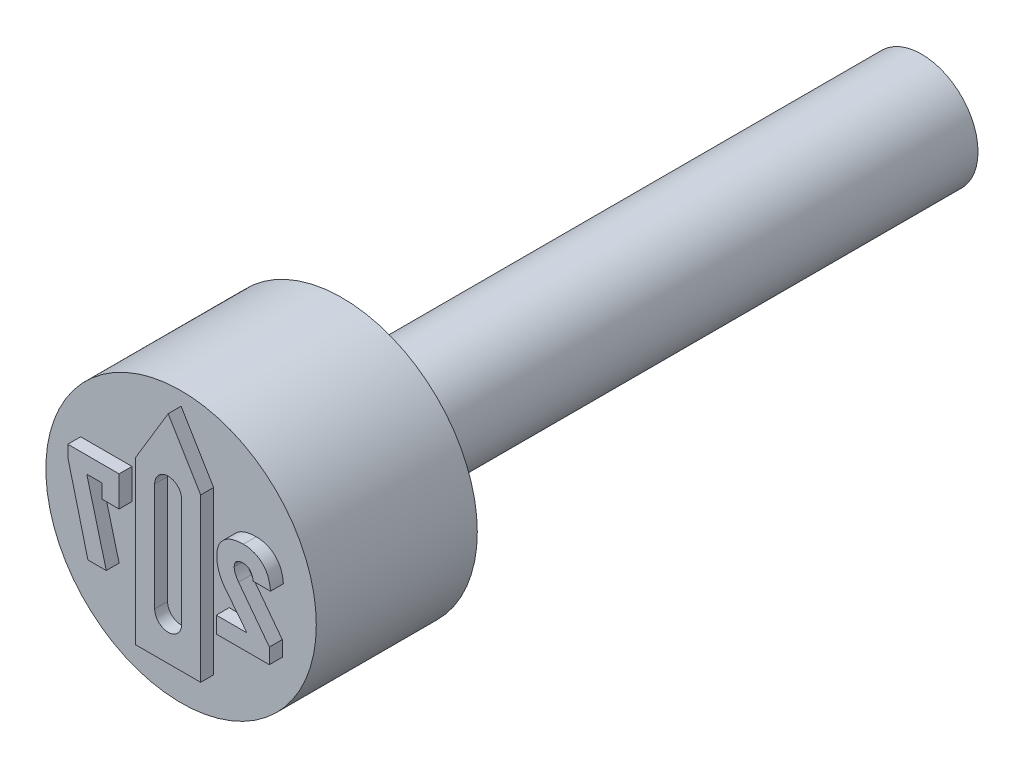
ISO-10303-21;
HEADER;
FILE_DESCRIPTION(('STEP AP214'),'2;1');
FILE_NAME('part.step','',(''),(''),'','','');
FILE_SCHEMA(('AUTOMOTIVE_DESIGN { 1 0 10303 214 1 1 1 1 }'));
ENDSEC;
DATA;
#1=APPLICATION_CONTEXT('core data for automotive mechanical design processes');
#2=APPLICATION_PROTOCOL_DEFINITION('international standard','automotive_design',2000,#1);
#3=PRODUCT_CONTEXT('',#1,'mechanical');
#4=PRODUCT('Part','Part','',(#3));
#5=PRODUCT_RELATED_PRODUCT_CATEGORY('part','',(#4));
#6=PRODUCT_DEFINITION_FORMATION('','',#4);
#7=PRODUCT_DEFINITION_CONTEXT('part definition',#1,'design');
#8=PRODUCT_DEFINITION('design','',#6,#7);
#9=PRODUCT_DEFINITION_SHAPE('','',#8);
#10=(LENGTH_UNIT() NAMED_UNIT(*) SI_UNIT(.MILLI.,.METRE.));
#11=(NAMED_UNIT(*) PLANE_ANGLE_UNIT() SI_UNIT($,.RADIAN.));
#12=(NAMED_UNIT(*) SI_UNIT($,.STERADIAN.) SOLID_ANGLE_UNIT());
#13=UNCERTAINTY_MEASURE_WITH_UNIT(LENGTH_MEASURE(1.E-05),#10,'distance_accuracy_value','');
#14=(GEOMETRIC_REPRESENTATION_CONTEXT(3) GLOBAL_UNCERTAINTY_ASSIGNED_CONTEXT((#13)) GLOBAL_UNIT_ASSIGNED_CONTEXT((#10,
#11,#12)) REPRESENTATION_CONTEXT('',''));
#15=CARTESIAN_POINT('',(0.,0.,0.));
#16=DIRECTION('',(0.,0.,1.));
#17=DIRECTION('',(1.,0.,0.));
#18=AXIS2_PLACEMENT_3D('',#15,#16,#17);
#19=CARTESIAN_POINT('',(0.,4.2,0.));
#20=DIRECTION('',(0.,0.,-1.));
#21=DIRECTION('',(-1.,0.,0.));
#22=AXIS2_PLACEMENT_3D('',#19,#20,#21);
#23=PLANE('',#22);
#24=DIRECTION('',(-1.,0.,0.));
#25=VECTOR('',#24,1.);
#26=CARTESIAN_POINT('',(-1.52454545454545,1.4,0.));
#27=LINE('',#26,#25);
#28=CARTESIAN_POINT('',(-1.52454545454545,1.4,0.));
#29=VERTEX_POINT('',#28);
#30=CARTESIAN_POINT('',(-3.11772727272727,1.4,0.));
#31=VERTEX_POINT('',#30);
#32=EDGE_CURVE('E342',#29,#31,#27,.T.);
#33=ORIENTED_EDGE('',*,*,#32,.F.);
#34=DIRECTION('',(0.,1.,0.));
#35=VECTOR('',#34,1.);
#36=CARTESIAN_POINT('',(-1.52454545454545,0.454545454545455,0.));
#37=LINE('',#36,#35);
#38=CARTESIAN_POINT('',(-1.52454545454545,0.454545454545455,0.));
#39=VERTEX_POINT('',#38);
#40=EDGE_CURVE('E347',#39,#29,#37,.T.);
#41=ORIENTED_EDGE('',*,*,#40,.F.);
#42=DIRECTION('',(1.,0.,0.));
#43=VECTOR('',#42,1.);
#44=CARTESIAN_POINT('',(-2.05011363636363,0.454545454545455,0.));
#45=LINE('',#44,#43);
#46=CARTESIAN_POINT('',(-2.05011363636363,0.454545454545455,0.));
#47=VERTEX_POINT('',#46);
#48=EDGE_CURVE('E384',#47,#39,#45,.T.);
#49=ORIENTED_EDGE('',*,*,#48,.F.);
#50=DIRECTION('',(0.,-1.,0.));
#51=VECTOR('',#50,1.);
#52=CARTESIAN_POINT('',(-2.05011363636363,0.890909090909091,0.));
#53=LINE('',#52,#51);
#54=CARTESIAN_POINT('',(-2.05011363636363,0.890909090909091,0.));
#55=VERTEX_POINT('',#54);
#56=EDGE_CURVE('E381',#55,#47,#53,.T.);
#57=ORIENTED_EDGE('',*,*,#56,.F.);
#58=DIRECTION('',(1.,0.,0.));
#59=VECTOR('',#58,1.);
#60=CARTESIAN_POINT('',(-2.52909090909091,0.890909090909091,0.));
#61=LINE('',#60,#59);
#62=CARTESIAN_POINT('',(-2.52909090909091,0.890909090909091,0.));
#63=VERTEX_POINT('',#62);
#64=EDGE_CURVE('E378',#63,#55,#61,.T.);
#65=ORIENTED_EDGE('',*,*,#64,.F.);
#66=DIRECTION('',(-0.255602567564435,0.966781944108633,0.));
#67=VECTOR('',#66,1.);
#68=CARTESIAN_POINT('',(-1.92340909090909,-1.4,0.));
#69=LINE('',#68,#67);
#70=CARTESIAN_POINT('',(-1.92340909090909,-1.4,0.));
#71=VERTEX_POINT('',#70);
#72=EDGE_CURVE('E375',#71,#63,#69,.T.);
#73=ORIENTED_EDGE('',*,*,#72,.F.);
#74=DIRECTION('',(1.,0.,0.));
#75=VECTOR('',#74,1.);
#76=CARTESIAN_POINT('',(-2.49272727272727,-1.4,0.));
#77=LINE('',#76,#75);
#78=CARTESIAN_POINT('',(-2.49272727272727,-1.4,0.));
#79=VERTEX_POINT('',#78);
#80=EDGE_CURVE('E372',#79,#71,#77,.T.);
#81=ORIENTED_EDGE('',*,*,#80,.F.);
#82=DIRECTION('',(0.247293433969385,-0.968940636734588,0.));
#83=VECTOR('',#82,1.);
#84=CARTESIAN_POINT('',(-3.11772727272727,1.04886363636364,0.));
#85=LINE('',#84,#83);
#86=CARTESIAN_POINT('',(-3.11772727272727,1.04886363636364,0.));
#87=VERTEX_POINT('',#86);
#88=EDGE_CURVE('E369',#87,#79,#85,.T.);
#89=ORIENTED_EDGE('',*,*,#88,.F.);
#90=DIRECTION('',(0.,-1.,0.));
#91=VECTOR('',#90,1.);
#92=CARTESIAN_POINT('',(-3.11772727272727,1.4,0.));
#93=LINE('',#92,#91);
#94=EDGE_CURVE('E366',#31,#87,#93,.T.);
#95=ORIENTED_EDGE('',*,*,#94,.F.);
#96=EDGE_LOOP('',(#33,#41,#49,#57,#65,#73,#81,#89,#95));
#97=FACE_BOUND('',#96,.T.);
#98=CARTESIAN_POINT('',(0.,0.,0.));
#99=DIRECTION('',(0.,0.,1.));
#100=DIRECTION('',(1.,0.,0.));
#101=AXIS2_PLACEMENT_3D('',#98,#99,#100);
#102=CIRCLE('',#101,4.2);
#103=CARTESIAN_POINT('',(4.2,0.,0.));
#104=VERTEX_POINT('',#103);
#105=EDGE_CURVE('E47',#104,#104,#102,.T.);
#106=ORIENTED_EDGE('',*,*,#105,.T.);
#107=EDGE_LOOP('',(#106));
#108=FACE_BOUND('',#107,.T.);
#109=DIRECTION('',(1.,0.,0.));
#110=VECTOR('',#109,1.);
#111=CARTESIAN_POINT('',(1.49375,-1.4,0.));
#112=LINE('',#111,#110);
#113=CARTESIAN_POINT('',(1.49375,-1.4,0.));
#114=VERTEX_POINT('',#113);
#115=CARTESIAN_POINT('',(3.14261363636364,-1.4,0.));
#116=VERTEX_POINT('',#115);
#117=EDGE_CURVE('E415',#114,#116,#112,.T.);
#118=ORIENTED_EDGE('',*,*,#117,.F.);
#119=DIRECTION('',(0.,-1.,0.));
#120=VECTOR('',#119,1.);
#121=CARTESIAN_POINT('',(1.49375,-0.890909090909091,0.));
#122=LINE('',#121,#120);
#123=CARTESIAN_POINT('',(1.49375,-0.890909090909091,0.));
#124=VERTEX_POINT('',#123);
#125=EDGE_CURVE('E420',#124,#114,#122,.T.);
#126=ORIENTED_EDGE('',*,*,#125,.F.);
#127=DIRECTION('',(-1.,0.,0.));
#128=VECTOR('',#127,1.);
#129=CARTESIAN_POINT('',(2.44659090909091,-0.890909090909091,0.));
#130=LINE('',#129,#128);
#131=CARTESIAN_POINT('',(2.44659090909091,-0.890909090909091,0.));
#132=VERTEX_POINT('',#131);
#133=EDGE_CURVE('E677',#132,#124,#130,.T.);
#134=ORIENTED_EDGE('',*,*,#133,.F.);
#135=DIRECTION('',(0.618183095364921,-0.786034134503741,0.));
#136=VECTOR('',#135,1.);
#137=CARTESIAN_POINT('',(1.76022727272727,-0.0181818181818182,0.));
#138=LINE('',#137,#136);
#139=CARTESIAN_POINT('',(1.76022727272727,-0.0181818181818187,0.));
#140=VERTEX_POINT('',#139);
#141=EDGE_CURVE('E671',#140,#132,#138,.T.);
#142=ORIENTED_EDGE('',*,*,#141,.F.);
#143=CARTESIAN_POINT('',(1.50909090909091,0.702272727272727,0.));
#144=CARTESIAN_POINT('',(1.50981532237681,0.670413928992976,0.));
#145=CARTESIAN_POINT('',(1.5112654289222,0.606640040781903,0.));
#146=CARTESIAN_POINT('',(1.52435496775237,0.511193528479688,0.));
#147=CARTESIAN_POINT('',(1.54544850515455,0.416234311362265,0.));
#148=CARTESIAN_POINT('',(1.5744173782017,0.322221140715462,0.));
#149=CARTESIAN_POINT('',(1.61040413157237,0.230782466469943,0.));
#150=CARTESIAN_POINT('',(1.65359515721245,0.143170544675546,0.));
#151=CARTESIAN_POINT('',(1.70234177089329,0.0593466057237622,0.));
#152=CARTESIAN_POINT('',(1.74096905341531,0.00761150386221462,0.));
#153=CARTESIAN_POINT('',(1.76022727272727,-0.0181818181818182,0.));
#154=B_SPLINE_CURVE_WITH_KNOTS('',3,(#143,#144,#145,#146,#147,#148,#149,#150,#151,#152,#153),
.UNSPECIFIED.,.F.,.F.,(4,1,1,1,1,1,1,1,4),(0.,0.123046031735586,0.246309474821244,
0.371480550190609,0.498560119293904,0.626024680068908,0.750715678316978,0.875715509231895,1.),.UNSPECIFIED.);
#155=CARTESIAN_POINT('',(1.50909090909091,0.702272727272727,0.));
#156=VERTEX_POINT('',#155);
#157=EDGE_CURVE('E666',#156,#140,#154,.T.);
#158=ORIENTED_EDGE('',*,*,#157,.F.);
#159=DIRECTION('',(0.,-1.,0.));
#160=VECTOR('',#159,1.);
#161=CARTESIAN_POINT('',(1.50909090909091,0.704545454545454,0.));
#162=LINE('',#161,#160);
#163=CARTESIAN_POINT('',(1.50909090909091,0.704545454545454,0.));
#164=VERTEX_POINT('',#163);
#165=EDGE_CURVE('E660',#164,#156,#162,.T.);
#166=ORIENTED_EDGE('',*,*,#165,.F.);
#167=CARTESIAN_POINT('',(2.33352272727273,1.43636363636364,0.));
#168=CARTESIAN_POINT('',(2.30167886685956,1.43591129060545,0.));
#169=CARTESIAN_POINT('',(2.23974677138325,1.43503153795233,0.));
#170=CARTESIAN_POINT('',(2.14958435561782,1.42553488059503,0.));
#171=CARTESIAN_POINT('',(2.06475108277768,1.41120165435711,0.));
#172=CARTESIAN_POINT('',(1.98538346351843,1.39023283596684,0.));
#173=CARTESIAN_POINT('',(1.9118001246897,1.36288086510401,0.));
#174=CARTESIAN_POINT('',(1.84378063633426,1.32990112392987,0.));
#175=CARTESIAN_POINT('',(1.78118281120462,1.29101257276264,0.));
#176=CARTESIAN_POINT('',(1.72448604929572,1.2461320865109,0.));
#177=CARTESIAN_POINT('',(1.67347297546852,1.19607505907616,0.));
#178=CARTESIAN_POINT('',(1.62956448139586,1.14033342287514,0.));
#179=CARTESIAN_POINT('',(1.59155440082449,1.08003398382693,0.));
#180=CARTESIAN_POINT('',(1.56184218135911,1.01400718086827,0.));
#181=CARTESIAN_POINT('',(1.53738069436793,0.943805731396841,0.));
#182=CARTESIAN_POINT('',(1.52154225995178,0.868171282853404,0.));
#183=CARTESIAN_POINT('',(1.5108691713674,0.787994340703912,0.));
#184=CARTESIAN_POINT('',(1.5096930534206,0.732802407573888,0.));
#185=CARTESIAN_POINT('',(1.50909090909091,0.704545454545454,0.));
#186=B_SPLINE_CURVE_WITH_KNOTS('',3,(#167,#168,#169,#170,#171,#172,#173,#174,#175,#176,#177,
#178,#179,#180,#181,#182,#183,#184,#185),.UNSPECIFIED.,.F.,.F.,(4,1,1,1,1,1,1,1,1,1,1,1,1,1,1,1,
4),(0.,0.0762312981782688,0.148259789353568,0.216860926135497,0.28210063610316,
0.344528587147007,0.404571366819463,0.462840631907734,0.520642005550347,0.577409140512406,
0.633580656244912,0.690215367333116,0.747647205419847,0.806597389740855,0.867894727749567,
0.932365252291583,1.),.UNSPECIFIED.);
#187=CARTESIAN_POINT('',(2.33352272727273,1.43636363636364,0.));
#188=VERTEX_POINT('',#187);
#189=EDGE_CURVE('E652',#188,#164,#186,.T.);
#190=ORIENTED_EDGE('',*,*,#189,.F.);
#191=CARTESIAN_POINT('',(3.17727272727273,0.596022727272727,0.));
#192=CARTESIAN_POINT('',(3.17461489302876,0.62847866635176,0.));
#193=CARTESIAN_POINT('',(3.1694268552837,0.691831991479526,0.));
#194=CARTESIAN_POINT('',(3.15241821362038,0.783475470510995,0.));
#195=CARTESIAN_POINT('',(3.13043521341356,0.869797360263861,0.));
#196=CARTESIAN_POINT('',(3.10246987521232,0.95078052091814,0.));
#197=CARTESIAN_POINT('',(3.06653431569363,1.02548725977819,0.));
#198=CARTESIAN_POINT('',(3.02615962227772,1.0954793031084,0.));
#199=CARTESIAN_POINT('',(2.97759898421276,1.15859183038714,0.));
#200=CARTESIAN_POINT('',(2.92444256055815,1.21693670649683,0.));
#201=CARTESIAN_POINT('',(2.86523581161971,1.26832602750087,0.));
#202=CARTESIAN_POINT('',(2.8021051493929,1.3136583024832,0.));
#203=CARTESIAN_POINT('',(2.73409593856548,1.35138210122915,0.));
#204=CARTESIAN_POINT('',(2.66224210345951,1.38267622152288,0.));
#205=CARTESIAN_POINT('',(2.58574698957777,1.40642757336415,0.));
#206=CARTESIAN_POINT('',(2.50560980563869,1.42421914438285,0.));
#207=CARTESIAN_POINT('',(2.42091072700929,1.43447959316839,0.));
#208=CARTESIAN_POINT('',(2.36309562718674,1.43572605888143,0.));
#209=CARTESIAN_POINT('',(2.33352272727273,1.43636363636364,0.));
#210=B_SPLINE_CURVE_WITH_KNOTS('',3,(#191,#192,#193,#194,#195,#196,#197,#198,#199,#200,#201,
#202,#203,#204,#205,#206,#207,#208,#209),.UNSPECIFIED.,.F.,.F.,(4,1,1,1,1,1,1,1,1,1,1,1,1,1,1,1,
4),(0.,0.0733268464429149,0.143132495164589,0.209679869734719,0.273918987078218,
0.33576228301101,0.396210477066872,0.455608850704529,0.514796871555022,0.573764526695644,
0.631900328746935,0.689592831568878,0.748648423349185,0.808163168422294,0.86976604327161,
0.933384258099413,1.),.UNSPECIFIED.);
#211=CARTESIAN_POINT('',(3.17727272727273,0.596022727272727,0.));
#212=VERTEX_POINT('',#211);
#213=EDGE_CURVE('E647',#212,#188,#210,.T.);
#214=ORIENTED_EDGE('',*,*,#213,.F.);
#215=DIRECTION('',(0.,1.,0.));
#216=VECTOR('',#215,1.);
#217=CARTESIAN_POINT('',(3.17727272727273,0.594318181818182,0.));
#218=LINE('',#217,#216);
#219=CARTESIAN_POINT('',(3.17727272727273,0.594318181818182,0.));
#220=VERTEX_POINT('',#219);
#221=EDGE_CURVE('E644',#220,#212,#218,.T.);
#222=ORIENTED_EDGE('',*,*,#221,.F.);
#223=DIRECTION('',(1.,0.,0.));
#224=VECTOR('',#223,1.);
#225=CARTESIAN_POINT('',(2.63863636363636,0.594318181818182,0.));
#226=LINE('',#225,#224);
#227=CARTESIAN_POINT('',(2.63863636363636,0.594318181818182,0.));
#228=VERTEX_POINT('',#227);
#229=EDGE_CURVE('E641',#228,#220,#226,.T.);
#230=ORIENTED_EDGE('',*,*,#229,.F.);
#231=DIRECTION('',(0.,-1.,0.));
#232=VECTOR('',#231,1.);
#233=CARTESIAN_POINT('',(2.63863636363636,0.596022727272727,0.));
#234=LINE('',#233,#232);
#235=CARTESIAN_POINT('',(2.63863636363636,0.596022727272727,0.));
#236=VERTEX_POINT('',#235);
#237=EDGE_CURVE('E635',#236,#228,#234,.T.);
#238=ORIENTED_EDGE('',*,*,#237,.F.);
#239=CARTESIAN_POINT('',(2.32954545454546,0.927272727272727,0.));
#240=CARTESIAN_POINT('',(2.35012956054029,0.926469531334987,0.));
#241=CARTESIAN_POINT('',(2.39012519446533,0.924908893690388,0.));
#242=CARTESIAN_POINT('',(2.4467458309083,0.907612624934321,0.));
#243=CARTESIAN_POINT('',(2.49776654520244,0.880482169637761,0.));
#244=CARTESIAN_POINT('',(2.54175045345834,0.841770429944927,0.));
#245=CARTESIAN_POINT('',(2.57817246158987,0.793166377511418,0.));
#246=CARTESIAN_POINT('',(2.60773244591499,0.73593110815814,0.));
#247=CARTESIAN_POINT('',(2.62780936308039,0.669031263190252,0.));
#248=CARTESIAN_POINT('',(2.63491123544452,0.621141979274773,0.));
#249=CARTESIAN_POINT('',(2.63863636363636,0.596022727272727,0.));
#250=B_SPLINE_CURVE_WITH_KNOTS('',3,(#239,#240,#241,#242,#243,#244,#245,#246,#247,#248,#249),
.UNSPECIFIED.,.F.,.F.,(4,1,1,1,1,1,1,1,4),(0.,0.122603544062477,0.238222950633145,
0.350089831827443,0.46555970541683,0.58502806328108,0.711014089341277,0.848418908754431,1.),.UNSPECIFIED.);
#251=CARTESIAN_POINT('',(2.32954545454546,0.927272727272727,0.));
#252=VERTEX_POINT('',#251);
#253=EDGE_CURVE('E627',#252,#236,#250,.T.);
#254=ORIENTED_EDGE('',*,*,#253,.F.);
#255=CARTESIAN_POINT('',(2.05,0.689772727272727,0.));
#256=CARTESIAN_POINT('',(2.05077616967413,0.707675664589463,0.));
#257=CARTESIAN_POINT('',(2.05226318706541,0.74197483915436,0.));
#258=CARTESIAN_POINT('',(2.06627322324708,0.79030304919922,0.));
#259=CARTESIAN_POINT('',(2.08923491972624,0.832389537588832,0.));
#260=CARTESIAN_POINT('',(2.12212161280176,0.867152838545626,0.));
#261=CARTESIAN_POINT('',(2.16306302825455,0.894648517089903,0.));
#262=CARTESIAN_POINT('',(2.21205056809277,0.914025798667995,0.));
#263=CARTESIAN_POINT('',(2.26844327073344,0.92513743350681,0.));
#264=CARTESIAN_POINT('',(2.30847060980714,0.926536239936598,0.));
#265=CARTESIAN_POINT('',(2.32954545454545,0.927272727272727,0.));
#266=B_SPLINE_CURVE_WITH_KNOTS('',3,(#255,#256,#257,#258,#259,#260,#261,#262,#263,#264,#265),
.UNSPECIFIED.,.F.,.F.,(4,1,1,1,1,1,1,1,4),(0.,0.128749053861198,0.246662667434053,
0.359069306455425,0.471077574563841,0.588039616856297,0.711712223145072,0.848213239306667,1.),.UNSPECIFIED.);
#267=CARTESIAN_POINT('',(2.05,0.689772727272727,0.));
#268=VERTEX_POINT('',#267);
#269=EDGE_CURVE('E622',#268,#252,#266,.T.);
#270=ORIENTED_EDGE('',*,*,#269,.F.);
#271=DIRECTION('',(0.,1.,0.));
#272=VECTOR('',#271,1.);
#273=CARTESIAN_POINT('',(2.05,0.685795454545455,0.));
#274=LINE('',#273,#272);
#275=CARTESIAN_POINT('',(2.05,0.685795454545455,0.));
#276=VERTEX_POINT('',#275);
#277=EDGE_CURVE('E616',#276,#268,#274,.T.);
#278=ORIENTED_EDGE('',*,*,#277,.F.);
#279=CARTESIAN_POINT('',(2.18579545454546,0.34375,0.));
#280=CARTESIAN_POINT('',(2.16575472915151,0.371988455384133,0.));
#281=CARTESIAN_POINT('',(2.12670598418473,0.427010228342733,0.));
#282=CARTESIAN_POINT('',(2.09136386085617,0.502571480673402,0.));
#283=CARTESIAN_POINT('',(2.06934717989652,0.561812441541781,0.));
#284=CARTESIAN_POINT('',(2.05885451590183,0.60477383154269,0.));
#285=CARTESIAN_POINT('',(2.0513693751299,0.645763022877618,0.));
#286=CARTESIAN_POINT('',(2.05044807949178,0.672696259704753,0.));
#287=CARTESIAN_POINT('',(2.05,0.685795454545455,0.));
#288=B_SPLINE_CURVE_WITH_KNOTS('',3,(#279,#280,#281,#282,#283,#284,#285,#286,#287),
.UNSPECIFIED.,.F.,.F.,(4,1,1,1,1,1,4),(0.,0.277375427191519,0.540457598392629,0.666416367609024,
0.784009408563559,0.894951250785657,1.),.UNSPECIFIED.);
#289=CARTESIAN_POINT('',(2.18579545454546,0.34375,0.));
#290=VERTEX_POINT('',#289);
#291=EDGE_CURVE('E611',#290,#276,#288,.T.);
#292=ORIENTED_EDGE('',*,*,#291,.F.);
#293=DIRECTION('',(-0.602458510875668,0.798150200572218,0.));
#294=VECTOR('',#293,1.);
#295=CARTESIAN_POINT('',(3.14261363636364,-0.923863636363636,0.));
#296=LINE('',#295,#294);
#297=CARTESIAN_POINT('',(3.14261363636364,-0.923863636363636,0.));
#298=VERTEX_POINT('',#297);
#299=EDGE_CURVE('E608',#298,#290,#296,.T.);
#300=ORIENTED_EDGE('',*,*,#299,.F.);
#301=DIRECTION('',(0.,1.,0.));
#302=VECTOR('',#301,1.);
#303=CARTESIAN_POINT('',(3.14261363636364,-1.4,0.));
#304=LINE('',#303,#302);
#305=EDGE_CURVE('E605',#116,#298,#304,.T.);
#306=ORIENTED_EDGE('',*,*,#305,.F.);
#307=EDGE_LOOP('',(#118,#126,#134,#142,#158,#166,#190,#214,#222,#230,#238,#254,#270,#278,#292,
#300,#306));
#308=FACE_BOUND('',#307,.T.);
#309=DIRECTION('',(0.,-1.,0.));
#310=VECTOR('',#309,1.);
#311=CARTESIAN_POINT('',(-1.01,2.1,0.));
#312=LINE('',#311,#310);
#313=CARTESIAN_POINT('',(-1.01,2.1,0.));
#314=VERTEX_POINT('',#313);
#315=CARTESIAN_POINT('',(-1.01,-2.94,0.));
#316=VERTEX_POINT('',#315);
#317=EDGE_CURVE('E301',#314,#316,#312,.T.);
#318=ORIENTED_EDGE('',*,*,#317,.F.);
#319=DIRECTION('',(-0.515038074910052,-0.857167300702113,0.));
#320=VECTOR('',#319,1.);
#321=CARTESIAN_POINT('',(0.,3.78092227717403,0.));
#322=LINE('',#321,#320);
#323=CARTESIAN_POINT('',(0.,3.78092227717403,0.));
#324=VERTEX_POINT('',#323);
#325=EDGE_CURVE('E309',#324,#314,#322,.T.);
#326=ORIENTED_EDGE('',*,*,#325,.F.);
#327=DIRECTION('',(-0.515038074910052,0.857167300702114,0.));
#328=VECTOR('',#327,1.);
#329=CARTESIAN_POINT('',(1.01,2.1,0.));
#330=LINE('',#329,#328);
#331=CARTESIAN_POINT('',(1.01,2.1,0.));
#332=VERTEX_POINT('',#331);
#333=EDGE_CURVE('E324',#332,#324,#330,.T.);
#334=ORIENTED_EDGE('',*,*,#333,.F.);
#335=DIRECTION('',(0.,1.,0.));
#336=VECTOR('',#335,1.);
#337=CARTESIAN_POINT('',(1.01,-2.94,0.));
#338=LINE('',#337,#336);
#339=CARTESIAN_POINT('',(1.01,-2.94,0.));
#340=VERTEX_POINT('',#339);
#341=EDGE_CURVE('E321',#340,#332,#338,.T.);
#342=ORIENTED_EDGE('',*,*,#341,.F.);
#343=DIRECTION('',(1.,0.,0.));
#344=VECTOR('',#343,1.);
#345=CARTESIAN_POINT('',(-1.01,-2.94,0.));
#346=LINE('',#345,#344);
#347=EDGE_CURVE('E62',#316,#340,#346,.T.);
#348=ORIENTED_EDGE('',*,*,#347,.F.);
#349=EDGE_LOOP('',(#318,#326,#334,#342,#348));
#350=FACE_BOUND('',#349,.T.);
#351=ADVANCED_FACE('F39',(#97,#108,#308,#350),#23,.F.);
#352=CARTESIAN_POINT('',(0.,1.75,-5.));
#353=DIRECTION('',(0.,0.,1.));
#354=DIRECTION('',(1.,0.,0.));
#355=AXIS2_PLACEMENT_3D('',#352,#353,#354);
#356=PLANE('',#355);
#357=CARTESIAN_POINT('',(0.,0.,-5.));
#358=DIRECTION('',(0.,0.,1.));
#359=DIRECTION('',(1.,0.,0.));
#360=AXIS2_PLACEMENT_3D('',#357,#358,#359);
#361=CIRCLE('',#360,4.2);
#362=CARTESIAN_POINT('',(4.2,0.,-5.));
#363=VERTEX_POINT('',#362);
#364=EDGE_CURVE('E11',#363,#363,#361,.T.);
#365=ORIENTED_EDGE('',*,*,#364,.F.);
#366=EDGE_LOOP('',(#365));
#367=FACE_BOUND('',#366,.T.);
#368=CARTESIAN_POINT('',(0.,0.,-5.));
#369=DIRECTION('',(0.,0.,1.));
#370=DIRECTION('',(1.,0.,0.));
#371=AXIS2_PLACEMENT_3D('',#368,#369,#370);
#372=CIRCLE('',#371,1.75);
#373=CARTESIAN_POINT('',(1.75,0.,-5.));
#374=VERTEX_POINT('',#373);
#375=EDGE_CURVE('E478',#374,#374,#372,.T.);
#376=ORIENTED_EDGE('',*,*,#375,.T.);
#377=EDGE_LOOP('',(#376));
#378=FACE_BOUND('',#377,.T.);
#379=ADVANCED_FACE('F41',(#367,#378),#356,.F.);
#380=CARTESIAN_POINT('',(0.,0.,-0.403888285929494));
#381=DIRECTION('',(0.,0.,1.));
#382=DIRECTION('',(1.,0.,0.));
#383=AXIS2_PLACEMENT_3D('',#380,#381,#382);
#384=CYLINDRICAL_SURFACE('',#383,4.2);
#385=ORIENTED_EDGE('',*,*,#105,.F.);
#386=EDGE_LOOP('',(#385));
#387=FACE_BOUND('',#386,.T.);
#388=ORIENTED_EDGE('',*,*,#364,.T.);
#389=EDGE_LOOP('',(#388));
#390=FACE_BOUND('',#389,.T.);
#391=ADVANCED_FACE('F461',(#387,#390),#384,.T.);
#392=CARTESIAN_POINT('',(0.,0.,-23.));
#393=DIRECTION('',(0.,0.,1.));
#394=DIRECTION('',(1.,0.,0.));
#395=AXIS2_PLACEMENT_3D('',#392,#393,#394);
#396=PLANE('',#395);
#397=CARTESIAN_POINT('',(0.,0.,-23.));
#398=DIRECTION('',(0.,0.,1.));
#399=DIRECTION('',(1.,0.,0.));
#400=AXIS2_PLACEMENT_3D('',#397,#398,#399);
#401=CIRCLE('',#400,1.75);
#402=CARTESIAN_POINT('',(1.75,0.,-23.));
#403=VERTEX_POINT('',#402);
#404=EDGE_CURVE('E479',#403,#403,#401,.T.);
#405=ORIENTED_EDGE('',*,*,#404,.F.);
#406=EDGE_LOOP('',(#405));
#407=FACE_BOUND('',#406,.T.);
#408=ADVANCED_FACE('F457',(#407),#396,.F.);
#409=CARTESIAN_POINT('',(0.,0.,-0.403888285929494));
#410=DIRECTION('',(0.,0.,1.));
#411=DIRECTION('',(1.,0.,0.));
#412=AXIS2_PLACEMENT_3D('',#409,#410,#411);
#413=CYLINDRICAL_SURFACE('',#412,1.75);
#414=ORIENTED_EDGE('',*,*,#375,.F.);
#415=EDGE_LOOP('',(#414));
#416=FACE_BOUND('',#415,.T.);
#417=ORIENTED_EDGE('',*,*,#404,.T.);
#418=EDGE_LOOP('',(#417));
#419=FACE_BOUND('',#418,.T.);
#420=ADVANCED_FACE('F453',(#416,#419),#413,.T.);
#421=CARTESIAN_POINT('',(1.49375,-1.4,0.4));
#422=DIRECTION('',(0.,1.,0.));
#423=DIRECTION('',(0.,0.,1.));
#424=AXIS2_PLACEMENT_3D('',#421,#422,#423);
#425=PLANE('',#424);
#426=ORIENTED_EDGE('',*,*,#117,.T.);
#427=DIRECTION('',(0.,0.,-1.));
#428=VECTOR('',#427,1.);
#429=CARTESIAN_POINT('',(3.14261363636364,-1.4,0.4));
#430=LINE('',#429,#428);
#431=CARTESIAN_POINT('',(3.14261363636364,-1.4,0.4));
#432=VERTEX_POINT('',#431);
#433=EDGE_CURVE('E480',#432,#116,#430,.T.);
#434=ORIENTED_EDGE('',*,*,#433,.F.);
#435=DIRECTION('',(1.,0.,0.));
#436=VECTOR('',#435,1.);
#437=CARTESIAN_POINT('',(1.49375,-1.4,0.4));
#438=LINE('',#437,#436);
#439=CARTESIAN_POINT('',(1.49375,-1.4,0.4));
#440=VERTEX_POINT('',#439);
#441=EDGE_CURVE('E416',#440,#432,#438,.T.);
#442=ORIENTED_EDGE('',*,*,#441,.F.);
#443=DIRECTION('',(0.,0.,-1.));
#444=VECTOR('',#443,1.);
#445=CARTESIAN_POINT('',(1.49375,-1.4,0.4));
#446=LINE('',#445,#444);
#447=EDGE_CURVE('E603',#440,#114,#446,.T.);
#448=ORIENTED_EDGE('',*,*,#447,.T.);
#449=EDGE_LOOP('',(#426,#434,#442,#448));
#450=FACE_BOUND('',#449,.T.);
#451=ADVANCED_FACE('F449',(#450),#425,.F.);
#452=CARTESIAN_POINT('',(3.14261363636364,-1.4,0.4));
#453=DIRECTION('',(-1.,0.,0.));
#454=DIRECTION('',(0.,0.,1.));
#455=AXIS2_PLACEMENT_3D('',#452,#453,#454);
#456=PLANE('',#455);
#457=ORIENTED_EDGE('',*,*,#305,.T.);
#458=DIRECTION('',(0.,0.,-1.));
#459=VECTOR('',#458,1.);
#460=CARTESIAN_POINT('',(3.14261363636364,-0.923863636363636,0.4));
#461=LINE('',#460,#459);
#462=CARTESIAN_POINT('',(3.14261363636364,-0.923863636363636,0.4));
#463=VERTEX_POINT('',#462);
#464=EDGE_CURVE('E485',#463,#298,#461,.T.);
#465=ORIENTED_EDGE('',*,*,#464,.F.);
#466=DIRECTION('',(0.,1.,0.));
#467=VECTOR('',#466,1.);
#468=CARTESIAN_POINT('',(3.14261363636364,-1.4,0.4));
#469=LINE('',#468,#467);
#470=EDGE_CURVE('E419',#432,#463,#469,.T.);
#471=ORIENTED_EDGE('',*,*,#470,.F.);
#472=ORIENTED_EDGE('',*,*,#433,.T.);
#473=EDGE_LOOP('',(#457,#465,#471,#472));
#474=FACE_BOUND('',#473,.T.);
#475=ADVANCED_FACE('F445',(#474),#456,.F.);
#476=CARTESIAN_POINT('',(3.14261363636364,-0.923863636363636,0.4));
#477=DIRECTION('',(-0.798150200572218,-0.602458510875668,0.));
#478=DIRECTION('',(0.602458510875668,-0.798150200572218,0.));
#479=AXIS2_PLACEMENT_3D('',#476,#477,#478);
#480=PLANE('',#479);
#481=ORIENTED_EDGE('',*,*,#299,.T.);
#482=DIRECTION('',(0.,0.,-1.));
#483=VECTOR('',#482,1.);
#484=CARTESIAN_POINT('',(2.18579545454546,0.34375,0.4));
#485=LINE('',#484,#483);
#486=CARTESIAN_POINT('',(2.18579545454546,0.34375,0.4));
#487=VERTEX_POINT('',#486);
#488=EDGE_CURVE('E722',#487,#290,#485,.T.);
#489=ORIENTED_EDGE('',*,*,#488,.F.);
#490=DIRECTION('',(-0.602458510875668,0.798150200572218,0.));
#491=VECTOR('',#490,1.);
#492=CARTESIAN_POINT('',(3.14261363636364,-0.923863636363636,0.4));
#493=LINE('',#492,#491);
#494=EDGE_CURVE('E422',#463,#487,#493,.T.);
#495=ORIENTED_EDGE('',*,*,#494,.F.);
#496=ORIENTED_EDGE('',*,*,#464,.T.);
#497=EDGE_LOOP('',(#481,#489,#495,#496));
#498=FACE_BOUND('',#497,.T.);
#499=ADVANCED_FACE('F440',(#498),#480,.F.);
#500=CARTESIAN_POINT('',(2.18579545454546,0.34375,0.4));
#501=CARTESIAN_POINT('',(2.16575472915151,0.371988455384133,0.4));
#502=CARTESIAN_POINT('',(2.12670598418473,0.427010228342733,0.4));
#503=CARTESIAN_POINT('',(2.09136386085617,0.502571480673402,0.4));
#504=CARTESIAN_POINT('',(2.06934717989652,0.561812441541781,0.4));
#505=CARTESIAN_POINT('',(2.05885451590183,0.60477383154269,0.4));
#506=CARTESIAN_POINT('',(2.0513693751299,0.645763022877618,0.4));
#507=CARTESIAN_POINT('',(2.05044807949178,0.672696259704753,0.4));
#508=CARTESIAN_POINT('',(2.05,0.685795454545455,0.4));
#509=B_SPLINE_CURVE_WITH_KNOTS('',3,(#500,#501,#502,#503,#504,#505,#506,#507,#508),
.UNSPECIFIED.,.F.,.F.,(4,1,1,1,1,1,4),(0.,0.277375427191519,0.540457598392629,0.666416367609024,
0.784009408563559,0.894951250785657,1.),.UNSPECIFIED.);
#510=DIRECTION('',(0.,0.,-1.));
#511=VECTOR('',#510,1.);
#512=SURFACE_OF_LINEAR_EXTRUSION('',#509,#511);
#513=ORIENTED_EDGE('',*,*,#291,.T.);
#514=DIRECTION('',(0.,0.,-1.));
#515=VECTOR('',#514,1.);
#516=CARTESIAN_POINT('',(2.05,0.685795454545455,0.4));
#517=LINE('',#516,#515);
#518=CARTESIAN_POINT('',(2.05,0.685795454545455,0.4));
#519=VERTEX_POINT('',#518);
#520=EDGE_CURVE('E719',#519,#276,#517,.T.);
#521=ORIENTED_EDGE('',*,*,#520,.F.);
#522=EDGE_CURVE('E424',#487,#519,#509,.T.);
#523=ORIENTED_EDGE('',*,*,#522,.F.);
#524=ORIENTED_EDGE('',*,*,#488,.T.);
#525=EDGE_LOOP('',(#513,#521,#523,#524));
#526=FACE_BOUND('',#525,.T.);
#527=ADVANCED_FACE('F435',(#526),#512,.F.);
#528=CARTESIAN_POINT('',(2.05,0.685795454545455,0.4));
#529=DIRECTION('',(-1.,0.,0.));
#530=DIRECTION('',(0.,0.,1.));
#531=AXIS2_PLACEMENT_3D('',#528,#529,#530);
#532=PLANE('',#531);
#533=ORIENTED_EDGE('',*,*,#277,.T.);
#534=DIRECTION('',(0.,0.,-1.));
#535=VECTOR('',#534,1.);
#536=CARTESIAN_POINT('',(2.05,0.689772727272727,0.4));
#537=LINE('',#536,#535);
#538=CARTESIAN_POINT('',(2.05,0.689772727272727,0.4));
#539=VERTEX_POINT('',#538);
#540=EDGE_CURVE('E716',#539,#268,#537,.T.);
#541=ORIENTED_EDGE('',*,*,#540,.F.);
#542=DIRECTION('',(0.,1.,0.));
#543=VECTOR('',#542,1.);
#544=CARTESIAN_POINT('',(2.05,0.685795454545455,0.4));
#545=LINE('',#544,#543);
#546=EDGE_CURVE('E429',#519,#539,#545,.T.);
#547=ORIENTED_EDGE('',*,*,#546,.F.);
#548=ORIENTED_EDGE('',*,*,#520,.T.);
#549=EDGE_LOOP('',(#533,#541,#547,#548));
#550=FACE_BOUND('',#549,.T.);
#551=ADVANCED_FACE('F439',(#550),#532,.F.);
#552=CARTESIAN_POINT('',(2.05,0.689772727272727,0.4));
#553=CARTESIAN_POINT('',(2.05077616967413,0.707675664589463,0.4));
#554=CARTESIAN_POINT('',(2.05226318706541,0.74197483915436,0.4));
#555=CARTESIAN_POINT('',(2.06627322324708,0.79030304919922,0.4));
#556=CARTESIAN_POINT('',(2.08923491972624,0.832389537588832,0.4));
#557=CARTESIAN_POINT('',(2.12212161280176,0.867152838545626,0.4));
#558=CARTESIAN_POINT('',(2.16306302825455,0.894648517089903,0.4));
#559=CARTESIAN_POINT('',(2.21205056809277,0.914025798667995,0.4));
#560=CARTESIAN_POINT('',(2.26844327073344,0.92513743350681,0.4));
#561=CARTESIAN_POINT('',(2.30847060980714,0.926536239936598,0.4));
#562=CARTESIAN_POINT('',(2.32954545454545,0.927272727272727,0.4));
#563=B_SPLINE_CURVE_WITH_KNOTS('',3,(#552,#553,#554,#555,#556,#557,#558,#559,#560,#561,#562),
.UNSPECIFIED.,.F.,.F.,(4,1,1,1,1,1,1,1,4),(0.,0.128749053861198,0.246662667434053,
0.359069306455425,0.471077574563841,0.588039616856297,0.711712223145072,0.848213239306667,1.),.UNSPECIFIED.);
#564=DIRECTION('',(0.,0.,-1.));
#565=VECTOR('',#564,1.);
#566=SURFACE_OF_LINEAR_EXTRUSION('',#563,#565);
#567=ORIENTED_EDGE('',*,*,#269,.T.);
#568=DIRECTION('',(0.,0.,-1.));
#569=VECTOR('',#568,1.);
#570=CARTESIAN_POINT('',(2.32954545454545,0.927272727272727,0.4));
#571=LINE('',#570,#569);
#572=CARTESIAN_POINT('',(2.32954545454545,0.927272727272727,0.4));
#573=VERTEX_POINT('',#572);
#574=EDGE_CURVE('E713',#573,#252,#571,.T.);
#575=ORIENTED_EDGE('',*,*,#574,.F.);
#576=EDGE_CURVE('E735',#539,#573,#563,.T.);
#577=ORIENTED_EDGE('',*,*,#576,.F.);
#578=ORIENTED_EDGE('',*,*,#540,.T.);
#579=EDGE_LOOP('',(#567,#575,#577,#578));
#580=FACE_BOUND('',#579,.T.);
#581=ADVANCED_FACE('F750',(#580),#566,.F.);
#582=CARTESIAN_POINT('',(2.32954545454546,0.927272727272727,0.4));
#583=CARTESIAN_POINT('',(2.35012956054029,0.926469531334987,0.4));
#584=CARTESIAN_POINT('',(2.39012519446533,0.924908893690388,0.4));
#585=CARTESIAN_POINT('',(2.4467458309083,0.907612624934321,0.4));
#586=CARTESIAN_POINT('',(2.49776654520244,0.880482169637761,0.4));
#587=CARTESIAN_POINT('',(2.54175045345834,0.841770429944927,0.4));
#588=CARTESIAN_POINT('',(2.57817246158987,0.793166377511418,0.4));
#589=CARTESIAN_POINT('',(2.60773244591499,0.73593110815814,0.4));
#590=CARTESIAN_POINT('',(2.62780936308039,0.669031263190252,0.4));
#591=CARTESIAN_POINT('',(2.63491123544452,0.621141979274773,0.4));
#592=CARTESIAN_POINT('',(2.63863636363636,0.596022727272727,0.4));
#593=B_SPLINE_CURVE_WITH_KNOTS('',3,(#582,#583,#584,#585,#586,#587,#588,#589,#590,#591,#592),
.UNSPECIFIED.,.F.,.F.,(4,1,1,1,1,1,1,1,4),(0.,0.122603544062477,0.238222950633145,
0.350089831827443,0.46555970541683,0.58502806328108,0.711014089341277,0.848418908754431,1.),.UNSPECIFIED.);
#594=DIRECTION('',(0.,0.,-1.));
#595=VECTOR('',#594,1.);
#596=SURFACE_OF_LINEAR_EXTRUSION('',#593,#595);
#597=ORIENTED_EDGE('',*,*,#253,.T.);
#598=DIRECTION('',(0.,0.,-1.));
#599=VECTOR('',#598,1.);
#600=CARTESIAN_POINT('',(2.63863636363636,0.596022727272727,0.4));
#601=LINE('',#600,#599);
#602=CARTESIAN_POINT('',(2.63863636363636,0.596022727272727,0.4));
#603=VERTEX_POINT('',#602);
#604=EDGE_CURVE('E710',#603,#236,#601,.T.);
#605=ORIENTED_EDGE('',*,*,#604,.F.);
#606=EDGE_CURVE('E736',#573,#603,#593,.T.);
#607=ORIENTED_EDGE('',*,*,#606,.F.);
#608=ORIENTED_EDGE('',*,*,#574,.T.);
#609=EDGE_LOOP('',(#597,#605,#607,#608));
#610=FACE_BOUND('',#609,.T.);
#611=ADVANCED_FACE('F753',(#610),#596,.F.);
#612=CARTESIAN_POINT('',(2.63863636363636,0.596022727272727,0.4));
#613=DIRECTION('',(1.,0.,0.));
#614=DIRECTION('',(0.,0.,-1.));
#615=AXIS2_PLACEMENT_3D('',#612,#613,#614);
#616=PLANE('',#615);
#617=ORIENTED_EDGE('',*,*,#237,.T.);
#618=DIRECTION('',(0.,0.,-1.));
#619=VECTOR('',#618,1.);
#620=CARTESIAN_POINT('',(2.63863636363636,0.594318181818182,0.4));
#621=LINE('',#620,#619);
#622=CARTESIAN_POINT('',(2.63863636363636,0.594318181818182,0.4));
#623=VERTEX_POINT('',#622);
#624=EDGE_CURVE('E707',#623,#228,#621,.T.);
#625=ORIENTED_EDGE('',*,*,#624,.F.);
#626=DIRECTION('',(0.,-1.,0.));
#627=VECTOR('',#626,1.);
#628=CARTESIAN_POINT('',(2.63863636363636,0.596022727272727,0.4));
#629=LINE('',#628,#627);
#630=EDGE_CURVE('E738',#603,#623,#629,.T.);
#631=ORIENTED_EDGE('',*,*,#630,.F.);
#632=ORIENTED_EDGE('',*,*,#604,.T.);
#633=EDGE_LOOP('',(#617,#625,#631,#632));
#634=FACE_BOUND('',#633,.T.);
#635=ADVANCED_FACE('F757',(#634),#616,.F.);
#636=CARTESIAN_POINT('',(2.63863636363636,0.594318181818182,0.4));
#637=DIRECTION('',(0.,1.,0.));
#638=DIRECTION('',(0.,0.,1.));
#639=AXIS2_PLACEMENT_3D('',#636,#637,#638);
#640=PLANE('',#639);
#641=ORIENTED_EDGE('',*,*,#229,.T.);
#642=DIRECTION('',(0.,0.,-1.));
#643=VECTOR('',#642,1.);
#644=CARTESIAN_POINT('',(3.17727272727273,0.594318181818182,0.4));
#645=LINE('',#644,#643);
#646=CARTESIAN_POINT('',(3.17727272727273,0.594318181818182,0.4));
#647=VERTEX_POINT('',#646);
#648=EDGE_CURVE('E704',#647,#220,#645,.T.);
#649=ORIENTED_EDGE('',*,*,#648,.F.);
#650=DIRECTION('',(1.,0.,0.));
#651=VECTOR('',#650,1.);
#652=CARTESIAN_POINT('',(2.63863636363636,0.594318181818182,0.4));
#653=LINE('',#652,#651);
#654=EDGE_CURVE('E813',#623,#647,#653,.T.);
#655=ORIENTED_EDGE('',*,*,#654,.F.);
#656=ORIENTED_EDGE('',*,*,#624,.T.);
#657=EDGE_LOOP('',(#641,#649,#655,#656));
#658=FACE_BOUND('',#657,.T.);
#659=ADVANCED_FACE('F761',(#658),#640,.F.);
#660=CARTESIAN_POINT('',(3.17727272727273,0.594318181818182,0.4));
#661=DIRECTION('',(-1.,0.,0.));
#662=DIRECTION('',(0.,0.,1.));
#663=AXIS2_PLACEMENT_3D('',#660,#661,#662);
#664=PLANE('',#663);
#665=ORIENTED_EDGE('',*,*,#221,.T.);
#666=DIRECTION('',(0.,0.,-1.));
#667=VECTOR('',#666,1.);
#668=CARTESIAN_POINT('',(3.17727272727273,0.596022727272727,0.4));
#669=LINE('',#668,#667);
#670=CARTESIAN_POINT('',(3.17727272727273,0.596022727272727,0.4));
#671=VERTEX_POINT('',#670);
#672=EDGE_CURVE('E701',#671,#212,#669,.T.);
#673=ORIENTED_EDGE('',*,*,#672,.F.);
#674=DIRECTION('',(0.,1.,0.));
#675=VECTOR('',#674,1.);
#676=CARTESIAN_POINT('',(3.17727272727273,0.594318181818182,0.4));
#677=LINE('',#676,#675);
#678=EDGE_CURVE('E781',#647,#671,#677,.T.);
#679=ORIENTED_EDGE('',*,*,#678,.F.);
#680=ORIENTED_EDGE('',*,*,#648,.T.);
#681=EDGE_LOOP('',(#665,#673,#679,#680));
#682=FACE_BOUND('',#681,.T.);
#683=ADVANCED_FACE('F765',(#682),#664,.F.);
#684=CARTESIAN_POINT('',(3.17727272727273,0.596022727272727,0.4));
#685=CARTESIAN_POINT('',(3.17461489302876,0.62847866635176,0.4));
#686=CARTESIAN_POINT('',(3.1694268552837,0.691831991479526,0.4));
#687=CARTESIAN_POINT('',(3.15241821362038,0.783475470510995,0.4));
#688=CARTESIAN_POINT('',(3.13043521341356,0.869797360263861,0.4));
#689=CARTESIAN_POINT('',(3.10246987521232,0.95078052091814,0.4));
#690=CARTESIAN_POINT('',(3.06653431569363,1.02548725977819,0.4));
#691=CARTESIAN_POINT('',(3.02615962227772,1.0954793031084,0.4));
#692=CARTESIAN_POINT('',(2.97759898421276,1.15859183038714,0.4));
#693=CARTESIAN_POINT('',(2.92444256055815,1.21693670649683,0.4));
#694=CARTESIAN_POINT('',(2.86523581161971,1.26832602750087,0.4));
#695=CARTESIAN_POINT('',(2.8021051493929,1.3136583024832,0.4));
#696=CARTESIAN_POINT('',(2.73409593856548,1.35138210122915,0.4));
#697=CARTESIAN_POINT('',(2.66224210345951,1.38267622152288,0.4));
#698=CARTESIAN_POINT('',(2.58574698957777,1.40642757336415,0.4));
#699=CARTESIAN_POINT('',(2.50560980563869,1.42421914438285,0.4));
#700=CARTESIAN_POINT('',(2.42091072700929,1.43447959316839,0.4));
#701=CARTESIAN_POINT('',(2.36309562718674,1.43572605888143,0.4));
#702=CARTESIAN_POINT('',(2.33352272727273,1.43636363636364,0.4));
#703=B_SPLINE_CURVE_WITH_KNOTS('',3,(#684,#685,#686,#687,#688,#689,#690,#691,#692,#693,#694,
#695,#696,#697,#698,#699,#700,#701,#702),.UNSPECIFIED.,.F.,.F.,(4,1,1,1,1,1,1,1,1,1,1,1,1,1,1,1,
4),(0.,0.0733268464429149,0.143132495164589,0.209679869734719,0.273918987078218,
0.33576228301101,0.396210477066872,0.455608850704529,0.514796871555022,0.573764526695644,
0.631900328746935,0.689592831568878,0.748648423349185,0.808163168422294,0.86976604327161,
0.933384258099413,1.),.UNSPECIFIED.);
#704=DIRECTION('',(0.,0.,-1.));
#705=VECTOR('',#704,1.);
#706=SURFACE_OF_LINEAR_EXTRUSION('',#703,#705);
#707=ORIENTED_EDGE('',*,*,#213,.T.);
#708=DIRECTION('',(0.,0.,-1.));
#709=VECTOR('',#708,1.);
#710=CARTESIAN_POINT('',(2.33352272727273,1.43636363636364,0.4));
#711=LINE('',#710,#709);
#712=CARTESIAN_POINT('',(2.33352272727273,1.43636363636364,0.4));
#713=VERTEX_POINT('',#712);
#714=EDGE_CURVE('E698',#713,#188,#711,.T.);
#715=ORIENTED_EDGE('',*,*,#714,.F.);
#716=EDGE_CURVE('E775',#671,#713,#703,.T.);
#717=ORIENTED_EDGE('',*,*,#716,.F.);
#718=ORIENTED_EDGE('',*,*,#672,.T.);
#719=EDGE_LOOP('',(#707,#715,#717,#718));
#720=FACE_BOUND('',#719,.T.);
#721=ADVANCED_FACE('F769',(#720),#706,.F.);
#722=CARTESIAN_POINT('',(2.33352272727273,1.43636363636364,0.4));
#723=CARTESIAN_POINT('',(2.30167886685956,1.43591129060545,0.4));
#724=CARTESIAN_POINT('',(2.23974677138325,1.43503153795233,0.4));
#725=CARTESIAN_POINT('',(2.14958435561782,1.42553488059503,0.4));
#726=CARTESIAN_POINT('',(2.06475108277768,1.41120165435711,0.4));
#727=CARTESIAN_POINT('',(1.98538346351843,1.39023283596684,0.4));
#728=CARTESIAN_POINT('',(1.9118001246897,1.36288086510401,0.4));
#729=CARTESIAN_POINT('',(1.84378063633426,1.32990112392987,0.4));
#730=CARTESIAN_POINT('',(1.78118281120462,1.29101257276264,0.4));
#731=CARTESIAN_POINT('',(1.72448604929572,1.2461320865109,0.4));
#732=CARTESIAN_POINT('',(1.67347297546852,1.19607505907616,0.4));
#733=CARTESIAN_POINT('',(1.62956448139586,1.14033342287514,0.4));
#734=CARTESIAN_POINT('',(1.59155440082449,1.08003398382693,0.4));
#735=CARTESIAN_POINT('',(1.56184218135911,1.01400718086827,0.4));
#736=CARTESIAN_POINT('',(1.53738069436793,0.943805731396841,0.4));
#737=CARTESIAN_POINT('',(1.52154225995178,0.868171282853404,0.4));
#738=CARTESIAN_POINT('',(1.5108691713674,0.787994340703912,0.4));
#739=CARTESIAN_POINT('',(1.5096930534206,0.732802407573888,0.4));
#740=CARTESIAN_POINT('',(1.50909090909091,0.704545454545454,0.4));
#741=B_SPLINE_CURVE_WITH_KNOTS('',3,(#722,#723,#724,#725,#726,#727,#728,#729,#730,#731,#732,
#733,#734,#735,#736,#737,#738,#739,#740),.UNSPECIFIED.,.F.,.F.,(4,1,1,1,1,1,1,1,1,1,1,1,1,1,1,1,
4),(0.,0.0762312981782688,0.148259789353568,0.216860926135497,0.28210063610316,
0.344528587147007,0.404571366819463,0.462840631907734,0.520642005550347,0.577409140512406,
0.633580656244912,0.690215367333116,0.747647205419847,0.806597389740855,0.867894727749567,
0.932365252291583,1.),.UNSPECIFIED.);
#742=DIRECTION('',(0.,0.,-1.));
#743=VECTOR('',#742,1.);
#744=SURFACE_OF_LINEAR_EXTRUSION('',#741,#743);
#745=ORIENTED_EDGE('',*,*,#189,.T.);
#746=DIRECTION('',(0.,0.,-1.));
#747=VECTOR('',#746,1.);
#748=CARTESIAN_POINT('',(1.50909090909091,0.704545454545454,0.4));
#749=LINE('',#748,#747);
#750=CARTESIAN_POINT('',(1.50909090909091,0.704545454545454,0.4));
#751=VERTEX_POINT('',#750);
#752=EDGE_CURVE('E695',#751,#164,#749,.T.);
#753=ORIENTED_EDGE('',*,*,#752,.F.);
#754=EDGE_CURVE('E780',#713,#751,#741,.T.);
#755=ORIENTED_EDGE('',*,*,#754,.F.);
#756=ORIENTED_EDGE('',*,*,#714,.T.);
#757=EDGE_LOOP('',(#745,#753,#755,#756));
#758=FACE_BOUND('',#757,.T.);
#759=ADVANCED_FACE('F773',(#758),#744,.F.);
#760=CARTESIAN_POINT('',(1.50909090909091,0.704545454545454,0.4));
#761=DIRECTION('',(1.,0.,0.));
#762=DIRECTION('',(0.,0.,-1.));
#763=AXIS2_PLACEMENT_3D('',#760,#761,#762);
#764=PLANE('',#763);
#765=ORIENTED_EDGE('',*,*,#165,.T.);
#766=DIRECTION('',(0.,0.,-1.));
#767=VECTOR('',#766,1.);
#768=CARTESIAN_POINT('',(1.50909090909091,0.702272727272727,0.4));
#769=LINE('',#768,#767);
#770=CARTESIAN_POINT('',(1.50909090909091,0.702272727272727,0.4));
#771=VERTEX_POINT('',#770);
#772=EDGE_CURVE('E692',#771,#156,#769,.T.);
#773=ORIENTED_EDGE('',*,*,#772,.F.);
#774=DIRECTION('',(0.,-1.,0.));
#775=VECTOR('',#774,1.);
#776=CARTESIAN_POINT('',(1.50909090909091,0.704545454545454,0.4));
#777=LINE('',#776,#775);
#778=EDGE_CURVE('E593',#751,#771,#777,.T.);
#779=ORIENTED_EDGE('',*,*,#778,.F.);
#780=ORIENTED_EDGE('',*,*,#752,.T.);
#781=EDGE_LOOP('',(#765,#773,#779,#780));
#782=FACE_BOUND('',#781,.T.);
#783=ADVANCED_FACE('F583',(#782),#764,.F.);
#784=CARTESIAN_POINT('',(1.50909090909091,0.702272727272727,0.4));
#785=CARTESIAN_POINT('',(1.50981532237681,0.670413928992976,0.4));
#786=CARTESIAN_POINT('',(1.5112654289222,0.606640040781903,0.4));
#787=CARTESIAN_POINT('',(1.52435496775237,0.511193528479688,0.4));
#788=CARTESIAN_POINT('',(1.54544850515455,0.416234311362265,0.4));
#789=CARTESIAN_POINT('',(1.5744173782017,0.322221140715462,0.4));
#790=CARTESIAN_POINT('',(1.61040413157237,0.230782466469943,0.4));
#791=CARTESIAN_POINT('',(1.65359515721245,0.143170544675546,0.4));
#792=CARTESIAN_POINT('',(1.70234177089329,0.0593466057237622,0.4));
#793=CARTESIAN_POINT('',(1.74096905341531,0.00761150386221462,0.4));
#794=CARTESIAN_POINT('',(1.76022727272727,-0.0181818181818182,0.4));
#795=B_SPLINE_CURVE_WITH_KNOTS('',3,(#784,#785,#786,#787,#788,#789,#790,#791,#792,#793,#794),
.UNSPECIFIED.,.F.,.F.,(4,1,1,1,1,1,1,1,4),(0.,0.123046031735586,0.246309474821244,
0.371480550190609,0.498560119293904,0.626024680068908,0.750715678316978,0.875715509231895,1.),.UNSPECIFIED.);
#796=DIRECTION('',(0.,0.,-1.));
#797=VECTOR('',#796,1.);
#798=SURFACE_OF_LINEAR_EXTRUSION('',#795,#797);
#799=ORIENTED_EDGE('',*,*,#157,.T.);
#800=DIRECTION('',(0.,0.,-1.));
#801=VECTOR('',#800,1.);
#802=CARTESIAN_POINT('',(1.76022727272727,-0.0181818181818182,0.4));
#803=LINE('',#802,#801);
#804=CARTESIAN_POINT('',(1.76022727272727,-0.0181818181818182,0.4));
#805=VERTEX_POINT('',#804);
#806=EDGE_CURVE('E689',#805,#140,#803,.T.);
#807=ORIENTED_EDGE('',*,*,#806,.F.);
#808=EDGE_CURVE('E586',#771,#805,#795,.T.);
#809=ORIENTED_EDGE('',*,*,#808,.F.);
#810=ORIENTED_EDGE('',*,*,#772,.T.);
#811=EDGE_LOOP('',(#799,#807,#809,#810));
#812=FACE_BOUND('',#811,.T.);
#813=ADVANCED_FACE('F578',(#812),#798,.F.);
#814=CARTESIAN_POINT('',(1.76022727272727,-0.0181818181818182,0.4));
#815=DIRECTION('',(0.786034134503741,0.618183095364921,0.));
#816=DIRECTION('',(-0.618183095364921,0.786034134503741,0.));
#817=AXIS2_PLACEMENT_3D('',#814,#815,#816);
#818=PLANE('',#817);
#819=ORIENTED_EDGE('',*,*,#141,.T.);
#820=DIRECTION('',(0.,0.,-1.));
#821=VECTOR('',#820,1.);
#822=CARTESIAN_POINT('',(2.44659090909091,-0.890909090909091,0.4));
#823=LINE('',#822,#821);
#824=CARTESIAN_POINT('',(2.44659090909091,-0.890909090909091,0.4));
#825=VERTEX_POINT('',#824);
#826=EDGE_CURVE('E686',#825,#132,#823,.T.);
#827=ORIENTED_EDGE('',*,*,#826,.F.);
#828=DIRECTION('',(0.618183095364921,-0.786034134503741,0.));
#829=VECTOR('',#828,1.);
#830=CARTESIAN_POINT('',(1.76022727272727,-0.0181818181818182,0.4));
#831=LINE('',#830,#829);
#832=EDGE_CURVE('E592',#805,#825,#831,.T.);
#833=ORIENTED_EDGE('',*,*,#832,.F.);
#834=ORIENTED_EDGE('',*,*,#806,.T.);
#835=EDGE_LOOP('',(#819,#827,#833,#834));
#836=FACE_BOUND('',#835,.T.);
#837=ADVANCED_FACE('F574',(#836),#818,.F.);
#838=CARTESIAN_POINT('',(2.44659090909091,-0.890909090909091,0.4));
#839=DIRECTION('',(0.,-1.,0.));
#840=DIRECTION('',(0.,0.,-1.));
#841=AXIS2_PLACEMENT_3D('',#838,#839,#840);
#842=PLANE('',#841);
#843=ORIENTED_EDGE('',*,*,#133,.T.);
#844=DIRECTION('',(0.,0.,-1.));
#845=VECTOR('',#844,1.);
#846=CARTESIAN_POINT('',(1.49375,-0.890909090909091,0.4));
#847=LINE('',#846,#845);
#848=CARTESIAN_POINT('',(1.49375,-0.890909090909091,0.4));
#849=VERTEX_POINT('',#848);
#850=EDGE_CURVE('E683',#849,#124,#847,.T.);
#851=ORIENTED_EDGE('',*,*,#850,.F.);
#852=DIRECTION('',(-1.,0.,0.));
#853=VECTOR('',#852,1.);
#854=CARTESIAN_POINT('',(2.44659090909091,-0.890909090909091,0.4));
#855=LINE('',#854,#853);
#856=EDGE_CURVE('E599',#825,#849,#855,.T.);
#857=ORIENTED_EDGE('',*,*,#856,.F.);
#858=ORIENTED_EDGE('',*,*,#826,.T.);
#859=EDGE_LOOP('',(#843,#851,#857,#858));
#860=FACE_BOUND('',#859,.T.);
#861=ADVANCED_FACE('F570',(#860),#842,.F.);
#862=CARTESIAN_POINT('',(1.49375,-0.890909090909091,0.4));
#863=DIRECTION('',(1.,0.,0.));
#864=DIRECTION('',(0.,0.,-1.));
#865=AXIS2_PLACEMENT_3D('',#862,#863,#864);
#866=PLANE('',#865);
#867=ORIENTED_EDGE('',*,*,#125,.T.);
#868=ORIENTED_EDGE('',*,*,#447,.F.);
#869=DIRECTION('',(0.,-1.,0.));
#870=VECTOR('',#869,1.);
#871=CARTESIAN_POINT('',(1.49375,-0.890909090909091,0.4));
#872=LINE('',#871,#870);
#873=EDGE_CURVE('E601',#849,#440,#872,.T.);
#874=ORIENTED_EDGE('',*,*,#873,.F.);
#875=ORIENTED_EDGE('',*,*,#850,.T.);
#876=EDGE_LOOP('',(#867,#868,#874,#875));
#877=FACE_BOUND('',#876,.T.);
#878=ADVANCED_FACE('F566',(#877),#866,.F.);
#879=CARTESIAN_POINT('',(2.09156986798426,0.504745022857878,0.4));
#880=DIRECTION('',(0.,0.,1.));
#881=DIRECTION('',(1.,0.,0.));
#882=AXIS2_PLACEMENT_3D('',#879,#880,#881);
#883=PLANE('',#882);
#884=ORIENTED_EDGE('',*,*,#441,.T.);
#885=ORIENTED_EDGE('',*,*,#470,.T.);
#886=ORIENTED_EDGE('',*,*,#494,.T.);
#887=ORIENTED_EDGE('',*,*,#522,.T.);
#888=ORIENTED_EDGE('',*,*,#546,.T.);
#889=ORIENTED_EDGE('',*,*,#576,.T.);
#890=ORIENTED_EDGE('',*,*,#606,.T.);
#891=ORIENTED_EDGE('',*,*,#630,.T.);
#892=ORIENTED_EDGE('',*,*,#654,.T.);
#893=ORIENTED_EDGE('',*,*,#678,.T.);
#894=ORIENTED_EDGE('',*,*,#716,.T.);
#895=ORIENTED_EDGE('',*,*,#754,.T.);
#896=ORIENTED_EDGE('',*,*,#778,.T.);
#897=ORIENTED_EDGE('',*,*,#808,.T.);
#898=ORIENTED_EDGE('',*,*,#832,.T.);
#899=ORIENTED_EDGE('',*,*,#856,.T.);
#900=ORIENTED_EDGE('',*,*,#873,.T.);
#901=EDGE_LOOP('',(#884,#885,#886,#887,#888,#889,#890,#891,#892,#893,#894,#895,#896,#897,#898,
#899,#900));
#902=FACE_BOUND('',#901,.T.);
#903=ADVANCED_FACE('F562',(#902),#883,.T.);
#904=CARTESIAN_POINT('',(-1.52454545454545,1.4,0.4));
#905=DIRECTION('',(0.,-1.,0.));
#906=DIRECTION('',(0.,0.,-1.));
#907=AXIS2_PLACEMENT_3D('',#904,#905,#906);
#908=PLANE('',#907);
#909=ORIENTED_EDGE('',*,*,#32,.T.);
#910=DIRECTION('',(0.,0.,-1.));
#911=VECTOR('',#910,1.);
#912=CARTESIAN_POINT('',(-3.11772727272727,1.4,0.4));
#913=LINE('',#912,#911);
#914=CARTESIAN_POINT('',(-3.11772727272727,1.4,0.4));
#915=VERTEX_POINT('',#914);
#916=EDGE_CURVE('E412',#915,#31,#913,.T.);
#917=ORIENTED_EDGE('',*,*,#916,.F.);
#918=DIRECTION('',(-1.,0.,0.));
#919=VECTOR('',#918,1.);
#920=CARTESIAN_POINT('',(-1.52454545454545,1.4,0.4));
#921=LINE('',#920,#919);
#922=CARTESIAN_POINT('',(-1.52454545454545,1.4,0.4));
#923=VERTEX_POINT('',#922);
#924=EDGE_CURVE('E343',#923,#915,#921,.T.);
#925=ORIENTED_EDGE('',*,*,#924,.F.);
#926=DIRECTION('',(0.,0.,-1.));
#927=VECTOR('',#926,1.);
#928=CARTESIAN_POINT('',(-1.52454545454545,1.4,0.4));
#929=LINE('',#928,#927);
#930=EDGE_CURVE('E363',#923,#29,#929,.T.);
#931=ORIENTED_EDGE('',*,*,#930,.T.);
#932=EDGE_LOOP('',(#909,#917,#925,#931));
#933=FACE_BOUND('',#932,.T.);
#934=ADVANCED_FACE('F558',(#933),#908,.F.);
#935=CARTESIAN_POINT('',(-3.11772727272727,1.4,0.4));
#936=DIRECTION('',(1.,0.,0.));
#937=DIRECTION('',(0.,0.,-1.));
#938=AXIS2_PLACEMENT_3D('',#935,#936,#937);
#939=PLANE('',#938);
#940=ORIENTED_EDGE('',*,*,#94,.T.);
#941=DIRECTION('',(0.,0.,-1.));
#942=VECTOR('',#941,1.);
#943=CARTESIAN_POINT('',(-3.11772727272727,1.04886363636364,0.4));
#944=LINE('',#943,#942);
#945=CARTESIAN_POINT('',(-3.11772727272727,1.04886363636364,0.4));
#946=VERTEX_POINT('',#945);
#947=EDGE_CURVE('E409',#946,#87,#944,.T.);
#948=ORIENTED_EDGE('',*,*,#947,.F.);
#949=DIRECTION('',(0.,-1.,0.));
#950=VECTOR('',#949,1.);
#951=CARTESIAN_POINT('',(-3.11772727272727,1.4,0.4));
#952=LINE('',#951,#950);
#953=EDGE_CURVE('E346',#915,#946,#952,.T.);
#954=ORIENTED_EDGE('',*,*,#953,.F.);
#955=ORIENTED_EDGE('',*,*,#916,.T.);
#956=EDGE_LOOP('',(#940,#948,#954,#955));
#957=FACE_BOUND('',#956,.T.);
#958=ADVANCED_FACE('F554',(#957),#939,.F.);
#959=CARTESIAN_POINT('',(-3.11772727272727,1.04886363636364,0.4));
#960=DIRECTION('',(0.968940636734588,0.247293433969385,0.));
#961=DIRECTION('',(-0.247293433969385,0.968940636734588,0.));
#962=AXIS2_PLACEMENT_3D('',#959,#960,#961);
#963=PLANE('',#962);
#964=ORIENTED_EDGE('',*,*,#88,.T.);
#965=DIRECTION('',(0.,0.,-1.));
#966=VECTOR('',#965,1.);
#967=CARTESIAN_POINT('',(-2.49272727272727,-1.4,0.4));
#968=LINE('',#967,#966);
#969=CARTESIAN_POINT('',(-2.49272727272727,-1.4,0.4));
#970=VERTEX_POINT('',#969);
#971=EDGE_CURVE('E406',#970,#79,#968,.T.);
#972=ORIENTED_EDGE('',*,*,#971,.F.);
#973=DIRECTION('',(0.247293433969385,-0.968940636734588,0.));
#974=VECTOR('',#973,1.);
#975=CARTESIAN_POINT('',(-3.11772727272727,1.04886363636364,0.4));
#976=LINE('',#975,#974);
#977=EDGE_CURVE('E349',#946,#970,#976,.T.);
#978=ORIENTED_EDGE('',*,*,#977,.F.);
#979=ORIENTED_EDGE('',*,*,#947,.T.);
#980=EDGE_LOOP('',(#964,#972,#978,#979));
#981=FACE_BOUND('',#980,.T.);
#982=ADVANCED_FACE('F550',(#981),#963,.F.);
#983=CARTESIAN_POINT('',(-2.49272727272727,-1.4,0.4));
#984=DIRECTION('',(0.,1.,0.));
#985=DIRECTION('',(0.,0.,1.));
#986=AXIS2_PLACEMENT_3D('',#983,#984,#985);
#987=PLANE('',#986);
#988=ORIENTED_EDGE('',*,*,#80,.T.);
#989=DIRECTION('',(0.,0.,-1.));
#990=VECTOR('',#989,1.);
#991=CARTESIAN_POINT('',(-1.92340909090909,-1.4,0.4));
#992=LINE('',#991,#990);
#993=CARTESIAN_POINT('',(-1.92340909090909,-1.4,0.4));
#994=VERTEX_POINT('',#993);
#995=EDGE_CURVE('E403',#994,#71,#992,.T.);
#996=ORIENTED_EDGE('',*,*,#995,.F.);
#997=DIRECTION('',(1.,0.,0.));
#998=VECTOR('',#997,1.);
#999=CARTESIAN_POINT('',(-2.49272727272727,-1.4,0.4));
#1000=LINE('',#999,#998);
#1001=EDGE_CURVE('E351',#970,#994,#1000,.T.);
#1002=ORIENTED_EDGE('',*,*,#1001,.F.);
#1003=ORIENTED_EDGE('',*,*,#971,.T.);
#1004=EDGE_LOOP('',(#988,#996,#1002,#1003));
#1005=FACE_BOUND('',#1004,.T.);
#1006=ADVANCED_FACE('F546',(#1005),#987,.F.);
#1007=CARTESIAN_POINT('',(-1.92340909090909,-1.4,0.4));
#1008=DIRECTION('',(-0.966781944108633,-0.255602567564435,0.));
#1009=DIRECTION('',(0.255602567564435,-0.966781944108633,0.));
#1010=AXIS2_PLACEMENT_3D('',#1007,#1008,#1009);
#1011=PLANE('',#1010);
#1012=ORIENTED_EDGE('',*,*,#72,.T.);
#1013=DIRECTION('',(0.,0.,-1.));
#1014=VECTOR('',#1013,1.);
#1015=CARTESIAN_POINT('',(-2.52909090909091,0.890909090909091,0.4));
#1016=LINE('',#1015,#1014);
#1017=CARTESIAN_POINT('',(-2.52909090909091,0.890909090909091,0.4));
#1018=VERTEX_POINT('',#1017);
#1019=EDGE_CURVE('E400',#1018,#63,#1016,.T.);
#1020=ORIENTED_EDGE('',*,*,#1019,.F.);
#1021=DIRECTION('',(-0.255602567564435,0.966781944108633,0.));
#1022=VECTOR('',#1021,1.);
#1023=CARTESIAN_POINT('',(-1.92340909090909,-1.4,0.4));
#1024=LINE('',#1023,#1022);
#1025=EDGE_CURVE('E353',#994,#1018,#1024,.T.);
#1026=ORIENTED_EDGE('',*,*,#1025,.F.);
#1027=ORIENTED_EDGE('',*,*,#995,.T.);
#1028=EDGE_LOOP('',(#1012,#1020,#1026,#1027));
#1029=FACE_BOUND('',#1028,.T.);
#1030=ADVANCED_FACE('F542',(#1029),#1011,.F.);
#1031=CARTESIAN_POINT('',(-2.52909090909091,0.890909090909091,0.4));
#1032=DIRECTION('',(0.,1.,0.));
#1033=DIRECTION('',(0.,0.,1.));
#1034=AXIS2_PLACEMENT_3D('',#1031,#1032,#1033);
#1035=PLANE('',#1034);
#1036=ORIENTED_EDGE('',*,*,#64,.T.);
#1037=DIRECTION('',(0.,0.,-1.));
#1038=VECTOR('',#1037,1.);
#1039=CARTESIAN_POINT('',(-2.05011363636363,0.890909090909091,0.4));
#1040=LINE('',#1039,#1038);
#1041=CARTESIAN_POINT('',(-2.05011363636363,0.890909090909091,0.4));
#1042=VERTEX_POINT('',#1041);
#1043=EDGE_CURVE('E397',#1042,#55,#1040,.T.);
#1044=ORIENTED_EDGE('',*,*,#1043,.F.);
#1045=DIRECTION('',(1.,0.,0.));
#1046=VECTOR('',#1045,1.);
#1047=CARTESIAN_POINT('',(-2.52909090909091,0.890909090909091,0.4));
#1048=LINE('',#1047,#1046);
#1049=EDGE_CURVE('E355',#1018,#1042,#1048,.T.);
#1050=ORIENTED_EDGE('',*,*,#1049,.F.);
#1051=ORIENTED_EDGE('',*,*,#1019,.T.);
#1052=EDGE_LOOP('',(#1036,#1044,#1050,#1051));
#1053=FACE_BOUND('',#1052,.T.);
#1054=ADVANCED_FACE('F538',(#1053),#1035,.F.);
#1055=CARTESIAN_POINT('',(-2.05011363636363,0.890909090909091,0.4));
#1056=DIRECTION('',(1.,0.,0.));
#1057=DIRECTION('',(0.,0.,-1.));
#1058=AXIS2_PLACEMENT_3D('',#1055,#1056,#1057);
#1059=PLANE('',#1058);
#1060=ORIENTED_EDGE('',*,*,#56,.T.);
#1061=DIRECTION('',(0.,0.,-1.));
#1062=VECTOR('',#1061,1.);
#1063=CARTESIAN_POINT('',(-2.05011363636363,0.454545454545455,0.4));
#1064=LINE('',#1063,#1062);
#1065=CARTESIAN_POINT('',(-2.05011363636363,0.454545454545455,0.4));
#1066=VERTEX_POINT('',#1065);
#1067=EDGE_CURVE('E394',#1066,#47,#1064,.T.);
#1068=ORIENTED_EDGE('',*,*,#1067,.F.);
#1069=DIRECTION('',(0.,-1.,0.));
#1070=VECTOR('',#1069,1.);
#1071=CARTESIAN_POINT('',(-2.05011363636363,0.890909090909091,0.4));
#1072=LINE('',#1071,#1070);
#1073=EDGE_CURVE('E357',#1042,#1066,#1072,.T.);
#1074=ORIENTED_EDGE('',*,*,#1073,.F.);
#1075=ORIENTED_EDGE('',*,*,#1043,.T.);
#1076=EDGE_LOOP('',(#1060,#1068,#1074,#1075));
#1077=FACE_BOUND('',#1076,.T.);
#1078=ADVANCED_FACE('F534',(#1077),#1059,.F.);
#1079=CARTESIAN_POINT('',(-2.05011363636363,0.454545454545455,0.4));
#1080=DIRECTION('',(0.,1.,0.));
#1081=DIRECTION('',(0.,0.,1.));
#1082=AXIS2_PLACEMENT_3D('',#1079,#1080,#1081);
#1083=PLANE('',#1082);
#1084=ORIENTED_EDGE('',*,*,#48,.T.);
#1085=DIRECTION('',(0.,0.,-1.));
#1086=VECTOR('',#1085,1.);
#1087=CARTESIAN_POINT('',(-1.52454545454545,0.454545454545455,0.4));
#1088=LINE('',#1087,#1086);
#1089=CARTESIAN_POINT('',(-1.52454545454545,0.454545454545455,0.4));
#1090=VERTEX_POINT('',#1089);
#1091=EDGE_CURVE('E391',#1090,#39,#1088,.T.);
#1092=ORIENTED_EDGE('',*,*,#1091,.F.);
#1093=DIRECTION('',(1.,0.,0.));
#1094=VECTOR('',#1093,1.);
#1095=CARTESIAN_POINT('',(-2.05011363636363,0.454545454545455,0.4));
#1096=LINE('',#1095,#1094);
#1097=EDGE_CURVE('E359',#1066,#1090,#1096,.T.);
#1098=ORIENTED_EDGE('',*,*,#1097,.F.);
#1099=ORIENTED_EDGE('',*,*,#1067,.T.);
#1100=EDGE_LOOP('',(#1084,#1092,#1098,#1099));
#1101=FACE_BOUND('',#1100,.T.);
#1102=ADVANCED_FACE('F530',(#1101),#1083,.F.);
#1103=CARTESIAN_POINT('',(-1.52454545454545,0.454545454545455,0.4));
#1104=DIRECTION('',(-1.,0.,0.));
#1105=DIRECTION('',(0.,0.,1.));
#1106=AXIS2_PLACEMENT_3D('',#1103,#1104,#1105);
#1107=PLANE('',#1106);
#1108=ORIENTED_EDGE('',*,*,#40,.T.);
#1109=ORIENTED_EDGE('',*,*,#930,.F.);
#1110=DIRECTION('',(0.,1.,0.));
#1111=VECTOR('',#1110,1.);
#1112=CARTESIAN_POINT('',(-1.52454545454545,0.454545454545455,0.4));
#1113=LINE('',#1112,#1111);
#1114=EDGE_CURVE('E361',#1090,#923,#1113,.T.);
#1115=ORIENTED_EDGE('',*,*,#1114,.F.);
#1116=ORIENTED_EDGE('',*,*,#1091,.T.);
#1117=EDGE_LOOP('',(#1108,#1109,#1115,#1116));
#1118=FACE_BOUND('',#1117,.T.);
#1119=ADVANCED_FACE('F526',(#1118),#1107,.F.);
#1120=CARTESIAN_POINT('',(0.,0.,0.4));
#1121=DIRECTION('',(0.,0.,1.));
#1122=DIRECTION('',(1.,0.,0.));
#1123=AXIS2_PLACEMENT_3D('',#1120,#1121,#1122);
#1124=PLANE('',#1123);
#1125=ORIENTED_EDGE('',*,*,#924,.T.);
#1126=ORIENTED_EDGE('',*,*,#953,.T.);
#1127=ORIENTED_EDGE('',*,*,#977,.T.);
#1128=ORIENTED_EDGE('',*,*,#1001,.T.);
#1129=ORIENTED_EDGE('',*,*,#1025,.T.);
#1130=ORIENTED_EDGE('',*,*,#1049,.T.);
#1131=ORIENTED_EDGE('',*,*,#1073,.T.);
#1132=ORIENTED_EDGE('',*,*,#1097,.T.);
#1133=ORIENTED_EDGE('',*,*,#1114,.T.);
#1134=EDGE_LOOP('',(#1125,#1126,#1127,#1128,#1129,#1130,#1131,#1132,#1133));
#1135=FACE_BOUND('',#1134,.T.);
#1136=ADVANCED_FACE('F520',(#1135),#1124,.T.);
#1137=CARTESIAN_POINT('',(-1.01,2.1,0.4));
#1138=DIRECTION('',(1.,0.,0.));
#1139=DIRECTION('',(0.,1.,0.));
#1140=AXIS2_PLACEMENT_3D('',#1137,#1138,#1139);
#1141=PLANE('',#1140);
#1142=ORIENTED_EDGE('',*,*,#317,.T.);
#1143=DIRECTION('',(0.,0.,-1.));
#1144=VECTOR('',#1143,1.);
#1145=CARTESIAN_POINT('',(-1.01,-2.94,0.4));
#1146=LINE('',#1145,#1144);
#1147=CARTESIAN_POINT('',(-1.01,-2.94,0.4));
#1148=VERTEX_POINT('',#1147);
#1149=EDGE_CURVE('E340',#1148,#316,#1146,.T.);
#1150=ORIENTED_EDGE('',*,*,#1149,.F.);
#1151=DIRECTION('',(0.,-1.,0.));
#1152=VECTOR('',#1151,1.);
#1153=CARTESIAN_POINT('',(-1.01,2.1,0.4));
#1154=LINE('',#1153,#1152);
#1155=CARTESIAN_POINT('',(-1.01,2.1,0.4));
#1156=VERTEX_POINT('',#1155);
#1157=EDGE_CURVE('E305',#1156,#1148,#1154,.T.);
#1158=ORIENTED_EDGE('',*,*,#1157,.F.);
#1159=DIRECTION('',(0.,0.,-1.));
#1160=VECTOR('',#1159,1.);
#1161=CARTESIAN_POINT('',(-1.01,2.1,0.4));
#1162=LINE('',#1161,#1160);
#1163=EDGE_CURVE('E317',#1156,#314,#1162,.T.);
#1164=ORIENTED_EDGE('',*,*,#1163,.T.);
#1165=EDGE_LOOP('',(#1142,#1150,#1158,#1164));
#1166=FACE_BOUND('',#1165,.T.);
#1167=ADVANCED_FACE('F500',(#1166),#1141,.F.);
#1168=CARTESIAN_POINT('',(-1.01,-2.94,0.4));
#1169=DIRECTION('',(0.,1.,0.));
#1170=DIRECTION('',(0.,0.,1.));
#1171=AXIS2_PLACEMENT_3D('',#1168,#1169,#1170);
#1172=PLANE('',#1171);
#1173=ORIENTED_EDGE('',*,*,#347,.T.);
#1174=DIRECTION('',(0.,0.,-1.));
#1175=VECTOR('',#1174,1.);
#1176=CARTESIAN_POINT('',(1.01,-2.94,0.4));
#1177=LINE('',#1176,#1175);
#1178=CARTESIAN_POINT('',(1.01,-2.94,0.4));
#1179=VERTEX_POINT('',#1178);
#1180=EDGE_CURVE('E337',#1179,#340,#1177,.T.);
#1181=ORIENTED_EDGE('',*,*,#1180,.F.);
#1182=DIRECTION('',(1.,0.,0.));
#1183=VECTOR('',#1182,1.);
#1184=CARTESIAN_POINT('',(-1.01,-2.94,0.4));
#1185=LINE('',#1184,#1183);
#1186=EDGE_CURVE('E308',#1148,#1179,#1185,.T.);
#1187=ORIENTED_EDGE('',*,*,#1186,.F.);
#1188=ORIENTED_EDGE('',*,*,#1149,.T.);
#1189=EDGE_LOOP('',(#1173,#1181,#1187,#1188));
#1190=FACE_BOUND('',#1189,.T.);
#1191=ADVANCED_FACE('F512',(#1190),#1172,.F.);
#1192=CARTESIAN_POINT('',(1.01,-2.94,0.4));
#1193=DIRECTION('',(-1.,0.,0.));
#1194=DIRECTION('',(0.,0.,1.));
#1195=AXIS2_PLACEMENT_3D('',#1192,#1193,#1194);
#1196=PLANE('',#1195);
#1197=ORIENTED_EDGE('',*,*,#341,.T.);
#1198=DIRECTION('',(0.,0.,-1.));
#1199=VECTOR('',#1198,1.);
#1200=CARTESIAN_POINT('',(1.01,2.1,0.4));
#1201=LINE('',#1200,#1199);
#1202=CARTESIAN_POINT('',(1.01,2.1,0.4));
#1203=VERTEX_POINT('',#1202);
#1204=EDGE_CURVE('E334',#1203,#332,#1201,.T.);
#1205=ORIENTED_EDGE('',*,*,#1204,.F.);
#1206=DIRECTION('',(0.,1.,0.));
#1207=VECTOR('',#1206,1.);
#1208=CARTESIAN_POINT('',(1.01,-2.94,0.4));
#1209=LINE('',#1208,#1207);
#1210=EDGE_CURVE('E311',#1179,#1203,#1209,.T.);
#1211=ORIENTED_EDGE('',*,*,#1210,.F.);
#1212=ORIENTED_EDGE('',*,*,#1180,.T.);
#1213=EDGE_LOOP('',(#1197,#1205,#1211,#1212));
#1214=FACE_BOUND('',#1213,.T.);
#1215=ADVANCED_FACE('F510',(#1214),#1196,.F.);
#1216=CARTESIAN_POINT('',(1.01,2.1,0.4));
#1217=DIRECTION('',(-0.857167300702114,-0.515038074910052,0.));
#1218=DIRECTION('',(0.515038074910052,-0.857167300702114,0.));
#1219=AXIS2_PLACEMENT_3D('',#1216,#1217,#1218);
#1220=PLANE('',#1219);
#1221=ORIENTED_EDGE('',*,*,#333,.T.);
#1222=DIRECTION('',(0.,0.,-1.));
#1223=VECTOR('',#1222,1.);
#1224=CARTESIAN_POINT('',(0.,3.78092227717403,0.4));
#1225=LINE('',#1224,#1223);
#1226=CARTESIAN_POINT('',(0.,3.78092227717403,0.4));
#1227=VERTEX_POINT('',#1226);
#1228=EDGE_CURVE('E331',#1227,#324,#1225,.T.);
#1229=ORIENTED_EDGE('',*,*,#1228,.F.);
#1230=DIRECTION('',(-0.515038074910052,0.857167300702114,0.));
#1231=VECTOR('',#1230,1.);
#1232=CARTESIAN_POINT('',(1.01,2.1,0.4));
#1233=LINE('',#1232,#1231);
#1234=EDGE_CURVE('E313',#1203,#1227,#1233,.T.);
#1235=ORIENTED_EDGE('',*,*,#1234,.F.);
#1236=ORIENTED_EDGE('',*,*,#1204,.T.);
#1237=EDGE_LOOP('',(#1221,#1229,#1235,#1236));
#1238=FACE_BOUND('',#1237,.T.);
#1239=ADVANCED_FACE('F508',(#1238),#1220,.F.);
#1240=CARTESIAN_POINT('',(0.,3.78092227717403,0.4));
#1241=DIRECTION('',(0.857167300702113,-0.515038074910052,0.));
#1242=DIRECTION('',(0.515038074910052,0.857167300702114,0.));
#1243=AXIS2_PLACEMENT_3D('',#1240,#1241,#1242);
#1244=PLANE('',#1243);
#1245=ORIENTED_EDGE('',*,*,#325,.T.);
#1246=ORIENTED_EDGE('',*,*,#1163,.F.);
#1247=DIRECTION('',(-0.515038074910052,-0.857167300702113,0.));
#1248=VECTOR('',#1247,1.);
#1249=CARTESIAN_POINT('',(0.,3.78092227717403,0.4));
#1250=LINE('',#1249,#1248);
#1251=EDGE_CURVE('E315',#1227,#1156,#1250,.T.);
#1252=ORIENTED_EDGE('',*,*,#1251,.F.);
#1253=ORIENTED_EDGE('',*,*,#1228,.T.);
#1254=EDGE_LOOP('',(#1245,#1246,#1252,#1253));
#1255=FACE_BOUND('',#1254,.T.);
#1256=ADVANCED_FACE('F496',(#1255),#1244,.F.);
#1257=CARTESIAN_POINT('',(0.,0.,0.4));
#1258=DIRECTION('',(0.,0.,1.));
#1259=DIRECTION('',(1.,0.,0.));
#1260=AXIS2_PLACEMENT_3D('',#1257,#1258,#1259);
#1261=PLANE('',#1260);
#1262=CARTESIAN_POINT('',(0.,1.68,0.4));
#1263=DIRECTION('',(0.,0.,1.));
#1264=DIRECTION('',(1.,0.,0.));
#1265=AXIS2_PLACEMENT_3D('',#1262,#1263,#1264);
#1266=CIRCLE('',#1265,0.42);
#1267=CARTESIAN_POINT('',(0.42,1.68,0.4));
#1268=VERTEX_POINT('',#1267);
#1269=CARTESIAN_POINT('',(-0.42,1.68,0.4));
#1270=VERTEX_POINT('',#1269);
#1271=EDGE_CURVE('E54',#1268,#1270,#1266,.T.);
#1272=ORIENTED_EDGE('',*,*,#1271,.F.);
#1273=DIRECTION('',(0.,1.,0.));
#1274=VECTOR('',#1273,1.);
#1275=CARTESIAN_POINT('',(0.42,1.68,0.4));
#1276=LINE('',#1275,#1274);
#1277=CARTESIAN_POINT('',(0.42,-1.68,0.4));
#1278=VERTEX_POINT('',#1277);
#1279=EDGE_CURVE('E286',#1278,#1268,#1276,.T.);
#1280=ORIENTED_EDGE('',*,*,#1279,.F.);
#1281=CARTESIAN_POINT('',(0.,-1.68,0.4));
#1282=DIRECTION('',(0.,0.,1.));
#1283=DIRECTION('',(1.,0.,0.));
#1284=AXIS2_PLACEMENT_3D('',#1281,#1282,#1283);
#1285=CIRCLE('',#1284,0.42);
#1286=CARTESIAN_POINT('',(-0.42,-1.68,0.4));
#1287=VERTEX_POINT('',#1286);
#1288=EDGE_CURVE('E289',#1287,#1278,#1285,.T.);
#1289=ORIENTED_EDGE('',*,*,#1288,.F.);
#1290=DIRECTION('',(0.,-1.,0.));
#1291=VECTOR('',#1290,1.);
#1292=CARTESIAN_POINT('',(-0.42,1.68,0.4));
#1293=LINE('',#1292,#1291);
#1294=EDGE_CURVE('E295',#1270,#1287,#1293,.T.);
#1295=ORIENTED_EDGE('',*,*,#1294,.F.);
#1296=EDGE_LOOP('',(#1272,#1280,#1289,#1295));
#1297=FACE_BOUND('',#1296,.T.);
#1298=ORIENTED_EDGE('',*,*,#1157,.T.);
#1299=ORIENTED_EDGE('',*,*,#1186,.T.);
#1300=ORIENTED_EDGE('',*,*,#1210,.T.);
#1301=ORIENTED_EDGE('',*,*,#1234,.T.);
#1302=ORIENTED_EDGE('',*,*,#1251,.T.);
#1303=EDGE_LOOP('',(#1298,#1299,#1300,#1301,#1302));
#1304=FACE_BOUND('',#1303,.T.);
#1305=ADVANCED_FACE('F502',(#1297,#1304),#1261,.T.);
#1306=CARTESIAN_POINT('',(0.,1.68,0.));
#1307=DIRECTION('',(0.,0.,1.));
#1308=DIRECTION('',(1.,0.,0.));
#1309=AXIS2_PLACEMENT_3D('',#1306,#1307,#1308);
#1310=CYLINDRICAL_SURFACE('',#1309,0.42);
#1311=ORIENTED_EDGE('',*,*,#1271,.T.);
#1312=DIRECTION('',(0.,0.,1.));
#1313=VECTOR('',#1312,1.);
#1314=CARTESIAN_POINT('',(-0.42,1.68,0.));
#1315=LINE('',#1314,#1313);
#1316=CARTESIAN_POINT('',(-0.42,1.68,0.));
#1317=VERTEX_POINT('',#1316);
#1318=EDGE_CURVE('E264',#1317,#1270,#1315,.T.);
#1319=ORIENTED_EDGE('',*,*,#1318,.F.);
#1320=CARTESIAN_POINT('',(0.,1.68,0.));
#1321=DIRECTION('',(0.,0.,1.));
#1322=DIRECTION('',(1.,0.,0.));
#1323=AXIS2_PLACEMENT_3D('',#1320,#1321,#1322);
#1324=CIRCLE('',#1323,0.42);
#1325=CARTESIAN_POINT('',(0.42,1.68,0.));
#1326=VERTEX_POINT('',#1325);
#1327=EDGE_CURVE('E268',#1326,#1317,#1324,.T.);
#1328=ORIENTED_EDGE('',*,*,#1327,.F.);
#1329=DIRECTION('',(0.,0.,1.));
#1330=VECTOR('',#1329,1.);
#1331=CARTESIAN_POINT('',(0.42,1.68,0.));
#1332=LINE('',#1331,#1330);
#1333=EDGE_CURVE('E299',#1326,#1268,#1332,.T.);
#1334=ORIENTED_EDGE('',*,*,#1333,.T.);
#1335=EDGE_LOOP('',(#1311,#1319,#1328,#1334));
#1336=FACE_BOUND('',#1335,.T.);
#1337=ADVANCED_FACE('F266',(#1336),#1310,.F.);
#1338=CARTESIAN_POINT('',(0.42,1.68,0.));
#1339=DIRECTION('',(1.,0.,0.));
#1340=DIRECTION('',(0.,1.,0.));
#1341=AXIS2_PLACEMENT_3D('',#1338,#1339,#1340);
#1342=PLANE('',#1341);
#1343=ORIENTED_EDGE('',*,*,#1279,.T.);
#1344=ORIENTED_EDGE('',*,*,#1333,.F.);
#1345=DIRECTION('',(0.,1.,0.));
#1346=VECTOR('',#1345,1.);
#1347=CARTESIAN_POINT('',(0.42,1.68,0.));
#1348=LINE('',#1347,#1346);
#1349=CARTESIAN_POINT('',(0.42,-1.68,0.));
#1350=VERTEX_POINT('',#1349);
#1351=EDGE_CURVE('E274',#1350,#1326,#1348,.T.);
#1352=ORIENTED_EDGE('',*,*,#1351,.F.);
#1353=DIRECTION('',(0.,0.,1.));
#1354=VECTOR('',#1353,1.);
#1355=CARTESIAN_POINT('',(0.42,-1.68,0.));
#1356=LINE('',#1355,#1354);
#1357=EDGE_CURVE('E302',#1350,#1278,#1356,.T.);
#1358=ORIENTED_EDGE('',*,*,#1357,.T.);
#1359=EDGE_LOOP('',(#1343,#1344,#1352,#1358));
#1360=FACE_BOUND('',#1359,.T.);
#1361=ADVANCED_FACE('F937',(#1360),#1342,.F.);
#1362=CARTESIAN_POINT('',(0.,-1.68,0.));
#1363=DIRECTION('',(0.,0.,1.));
#1364=DIRECTION('',(1.,0.,0.));
#1365=AXIS2_PLACEMENT_3D('',#1362,#1363,#1364);
#1366=CYLINDRICAL_SURFACE('',#1365,0.42);
#1367=ORIENTED_EDGE('',*,*,#1288,.T.);
#1368=ORIENTED_EDGE('',*,*,#1357,.F.);
#1369=CARTESIAN_POINT('',(0.,-1.68,0.));
#1370=DIRECTION('',(0.,0.,1.));
#1371=DIRECTION('',(1.,0.,0.));
#1372=AXIS2_PLACEMENT_3D('',#1369,#1370,#1371);
#1373=CIRCLE('',#1372,0.42);
#1374=CARTESIAN_POINT('',(-0.42,-1.68,0.));
#1375=VERTEX_POINT('',#1374);
#1376=EDGE_CURVE('E282',#1375,#1350,#1373,.T.);
#1377=ORIENTED_EDGE('',*,*,#1376,.F.);
#1378=DIRECTION('',(0.,0.,1.));
#1379=VECTOR('',#1378,1.);
#1380=CARTESIAN_POINT('',(-0.42,-1.68,0.));
#1381=LINE('',#1380,#1379);
#1382=EDGE_CURVE('E273',#1375,#1287,#1381,.T.);
#1383=ORIENTED_EDGE('',*,*,#1382,.T.);
#1384=EDGE_LOOP('',(#1367,#1368,#1377,#1383));
#1385=FACE_BOUND('',#1384,.T.);
#1386=ADVANCED_FACE('F947',(#1385),#1366,.F.);
#1387=CARTESIAN_POINT('',(-0.42,1.68,0.));
#1388=DIRECTION('',(-1.,0.,0.));
#1389=DIRECTION('',(0.,-1.,0.));
#1390=AXIS2_PLACEMENT_3D('',#1387,#1388,#1389);
#1391=PLANE('',#1390);
#1392=ORIENTED_EDGE('',*,*,#1294,.T.);
#1393=ORIENTED_EDGE('',*,*,#1382,.F.);
#1394=DIRECTION('',(0.,-1.,0.));
#1395=VECTOR('',#1394,1.);
#1396=CARTESIAN_POINT('',(-0.42,1.68,0.));
#1397=LINE('',#1396,#1395);
#1398=EDGE_CURVE('E277',#1317,#1375,#1397,.T.);
#1399=ORIENTED_EDGE('',*,*,#1398,.F.);
#1400=ORIENTED_EDGE('',*,*,#1318,.T.);
#1401=EDGE_LOOP('',(#1392,#1393,#1399,#1400));
#1402=FACE_BOUND('',#1401,.T.);
#1403=ADVANCED_FACE('F278',(#1402),#1391,.F.);
#1404=CARTESIAN_POINT('',(0.,1.68,0.));
#1405=DIRECTION('',(0.,0.,1.));
#1406=DIRECTION('',(1.,0.,0.));
#1407=AXIS2_PLACEMENT_3D('',#1404,#1405,#1406);
#1408=PLANE('',#1407);
#1409=ORIENTED_EDGE('',*,*,#1327,.T.);
#1410=ORIENTED_EDGE('',*,*,#1398,.T.);
#1411=ORIENTED_EDGE('',*,*,#1376,.T.);
#1412=ORIENTED_EDGE('',*,*,#1351,.T.);
#1413=EDGE_LOOP('',(#1409,#1410,#1411,#1412));
#1414=FACE_BOUND('',#1413,.T.);
#1415=ADVANCED_FACE('F284',(#1414),#1408,.T.);
#1416=CLOSED_SHELL('',(#351,#379,#391,#408,#420,#451,#475,#499,#527,#551,#581,#611,#635,#659,
#683,#721,#759,#783,#813,#837,#861,#878,#903,#934,#958,#982,#1006,#1030,#1054,#1078,#1102,#1119,
#1136,#1167,#1191,#1215,#1239,#1256,#1305,#1337,#1361,#1386,#1403,#1415));
#1417=MANIFOLD_SOLID_BREP('B2',#1416);
#1418=ADVANCED_BREP_SHAPE_REPRESENTATION('',(#18,#1417),#14);
#1419=SHAPE_DEFINITION_REPRESENTATION(#9,#1418);
ENDSEC;
END-ISO-10303-21;
